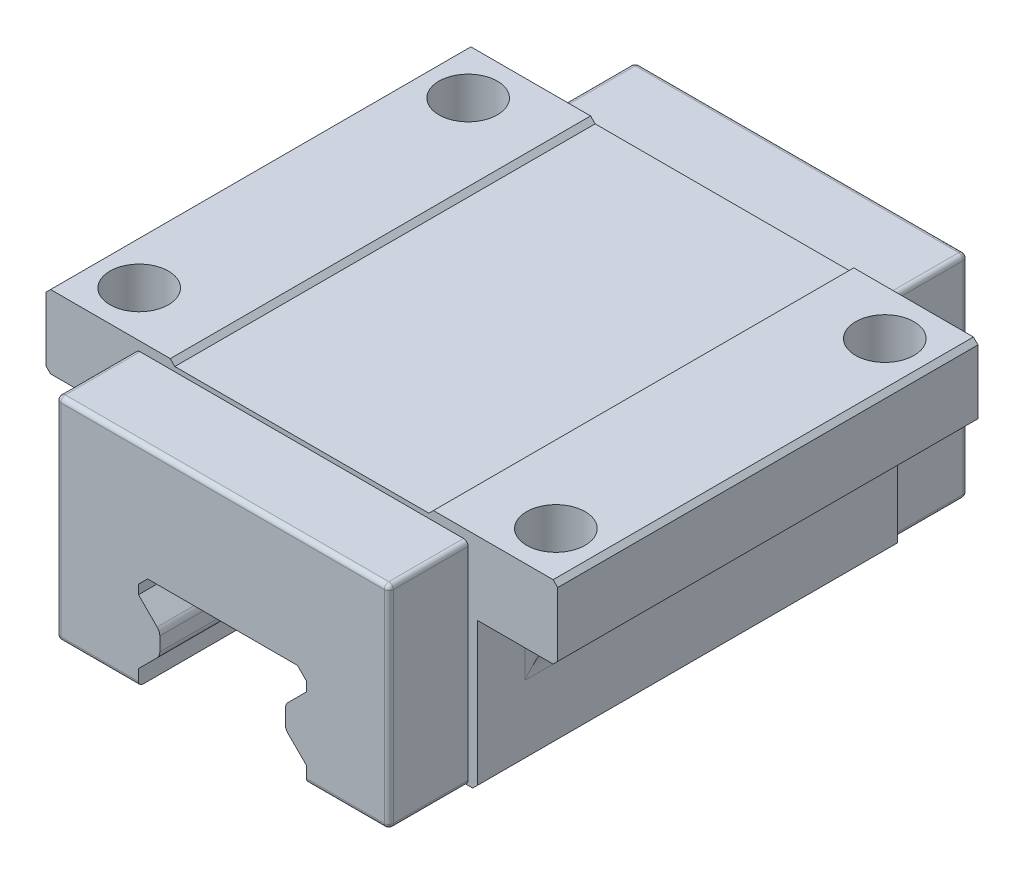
ISO-10303-21;
HEADER;
FILE_DESCRIPTION(('STEP AP214'),'2;1');
FILE_NAME('part.step','',(''),(''),'','','');
FILE_SCHEMA(('AUTOMOTIVE_DESIGN { 1 0 10303 214 1 1 1 1 }'));
ENDSEC;
DATA;
#1=APPLICATION_CONTEXT('core data for automotive mechanical design processes');
#2=APPLICATION_PROTOCOL_DEFINITION('international standard','automotive_design',2000,#1);
#3=PRODUCT_CONTEXT('',#1,'mechanical');
#4=PRODUCT('Part','Part','',(#3));
#5=PRODUCT_RELATED_PRODUCT_CATEGORY('part','',(#4));
#6=PRODUCT_DEFINITION_FORMATION('','',#4);
#7=PRODUCT_DEFINITION_CONTEXT('part definition',#1,'design');
#8=PRODUCT_DEFINITION('design','',#6,#7);
#9=PRODUCT_DEFINITION_SHAPE('','',#8);
#10=(LENGTH_UNIT() NAMED_UNIT(*) SI_UNIT(.MILLI.,.METRE.));
#11=(NAMED_UNIT(*) PLANE_ANGLE_UNIT() SI_UNIT($,.RADIAN.));
#12=(NAMED_UNIT(*) SI_UNIT($,.STERADIAN.) SOLID_ANGLE_UNIT());
#13=UNCERTAINTY_MEASURE_WITH_UNIT(LENGTH_MEASURE(1.E-05),#10,'distance_accuracy_value','');
#14=(GEOMETRIC_REPRESENTATION_CONTEXT(3) GLOBAL_UNCERTAINTY_ASSIGNED_CONTEXT((#13)) GLOBAL_UNIT_ASSIGNED_CONTEXT((#10,
#11,#12)) REPRESENTATION_CONTEXT('',''));
#15=CARTESIAN_POINT('',(0.,0.,0.));
#16=DIRECTION('',(0.,0.,1.));
#17=DIRECTION('',(1.,0.,0.));
#18=AXIS2_PLACEMENT_3D('',#15,#16,#17);
#19=CARTESIAN_POINT('',(35.,26.,16.25));
#20=DIRECTION('',(0.,1.,0.));
#21=DIRECTION('',(0.,0.,1.));
#22=AXIS2_PLACEMENT_3D('',#19,#20,#21);
#23=PLANE('',#22);
#24=CARTESIAN_POINT('',(28.5,26.,-22.5));
#25=DIRECTION('',(0.,-1.,0.));
#26=DIRECTION('',(-1.,0.,0.));
#27=AXIS2_PLACEMENT_3D('',#24,#25,#26);
#28=CIRCLE('',#27,4.);
#29=CARTESIAN_POINT('',(24.5,26.,-22.5));
#30=VERTEX_POINT('',#29);
#31=EDGE_CURVE('E1648',#30,#30,#28,.T.);
#32=ORIENTED_EDGE('',*,*,#31,.F.);
#33=EDGE_LOOP('',(#32));
#34=FACE_BOUND('',#33,.T.);
#35=DIRECTION('',(-1.,0.,0.));
#36=VECTOR('',#35,1.);
#37=CARTESIAN_POINT('',(34.375,26.,-16.25));
#38=LINE('',#37,#36);
#39=CARTESIAN_POINT('',(34.375,26.,-16.25));
#40=VERTEX_POINT('',#39);
#41=CARTESIAN_POINT('',(30.,26.,-16.25));
#42=VERTEX_POINT('',#41);
#43=EDGE_CURVE('E1637',#40,#42,#38,.T.);
#44=ORIENTED_EDGE('',*,*,#43,.T.);
#45=CARTESIAN_POINT('',(30.,26.,-22.25));
#46=DIRECTION('',(0.,1.,0.));
#47=DIRECTION('',(0.,0.,1.));
#48=AXIS2_PLACEMENT_3D('',#45,#46,#47);
#49=CIRCLE('',#48,6.);
#50=CARTESIAN_POINT('',(24.,26.,-22.25));
#51=VERTEX_POINT('',#50);
#52=EDGE_CURVE('E477',#42,#51,#49,.F.);
#53=ORIENTED_EDGE('',*,*,#52,.T.);
#54=DIRECTION('',(0.,0.,-1.));
#55=VECTOR('',#54,1.);
#56=CARTESIAN_POINT('',(24.,26.,28.75));
#57=LINE('',#56,#55);
#58=CARTESIAN_POINT('',(24.,26.,-28.75));
#59=VERTEX_POINT('',#58);
#60=EDGE_CURVE('E471',#51,#59,#57,.T.);
#61=ORIENTED_EDGE('',*,*,#60,.T.);
#62=DIRECTION('',(1.,0.,0.));
#63=VECTOR('',#62,1.);
#64=CARTESIAN_POINT('',(35.,26.,-28.75));
#65=LINE('',#64,#63);
#66=CARTESIAN_POINT('',(34.375,26.,-28.75));
#67=VERTEX_POINT('',#66);
#68=EDGE_CURVE('E475',#59,#67,#65,.T.);
#69=ORIENTED_EDGE('',*,*,#68,.T.);
#70=DIRECTION('',(0.,0.,1.));
#71=VECTOR('',#70,1.);
#72=CARTESIAN_POINT('',(34.375,26.,16.25));
#73=LINE('',#72,#71);
#74=EDGE_CURVE('E975',#67,#40,#73,.T.);
#75=ORIENTED_EDGE('',*,*,#74,.T.);
#76=EDGE_LOOP('',(#44,#53,#61,#69,#75));
#77=FACE_BOUND('',#76,.T.);
#78=ADVANCED_FACE('F39',(#34,#77),#23,.F.);
#79=CARTESIAN_POINT('',(-35.,26.,16.25));
#80=DIRECTION('',(0.,1.,0.));
#81=DIRECTION('',(0.,0.,1.));
#82=AXIS2_PLACEMENT_3D('',#79,#80,#81);
#83=PLANE('',#82);
#84=CARTESIAN_POINT('',(-28.5,26.,22.5));
#85=DIRECTION('',(0.,1.,0.));
#86=DIRECTION('',(-1.,0.,0.));
#87=AXIS2_PLACEMENT_3D('',#84,#85,#86);
#88=CIRCLE('',#87,4.);
#89=CARTESIAN_POINT('',(-32.5,26.,22.5));
#90=VERTEX_POINT('',#89);
#91=EDGE_CURVE('E495',#90,#90,#88,.T.);
#92=ORIENTED_EDGE('',*,*,#91,.T.);
#93=EDGE_LOOP('',(#92));
#94=FACE_BOUND('',#93,.T.);
#95=DIRECTION('',(1.,0.,0.));
#96=VECTOR('',#95,1.);
#97=CARTESIAN_POINT('',(-34.375,26.,16.25));
#98=LINE('',#97,#96);
#99=CARTESIAN_POINT('',(-34.375,26.,16.25));
#100=VERTEX_POINT('',#99);
#101=CARTESIAN_POINT('',(-30.,26.,16.25));
#102=VERTEX_POINT('',#101);
#103=EDGE_CURVE('E1358',#100,#102,#98,.T.);
#104=ORIENTED_EDGE('',*,*,#103,.T.);
#105=CARTESIAN_POINT('',(-30.,26.,22.25));
#106=DIRECTION('',(0.,1.,0.));
#107=DIRECTION('',(0.,0.,1.));
#108=AXIS2_PLACEMENT_3D('',#105,#106,#107);
#109=CIRCLE('',#108,6.);
#110=CARTESIAN_POINT('',(-24.,26.,22.25));
#111=VERTEX_POINT('',#110);
#112=EDGE_CURVE('E986',#102,#111,#109,.F.);
#113=ORIENTED_EDGE('',*,*,#112,.T.);
#114=DIRECTION('',(0.,0.,1.));
#115=VECTOR('',#114,1.);
#116=CARTESIAN_POINT('',(-24.,26.,28.75));
#117=LINE('',#116,#115);
#118=CARTESIAN_POINT('',(-24.,26.,28.75));
#119=VERTEX_POINT('',#118);
#120=EDGE_CURVE('E1362',#111,#119,#117,.T.);
#121=ORIENTED_EDGE('',*,*,#120,.T.);
#122=DIRECTION('',(1.,0.,0.));
#123=VECTOR('',#122,1.);
#124=CARTESIAN_POINT('',(-35.,26.,28.75));
#125=LINE('',#124,#123);
#126=CARTESIAN_POINT('',(-34.375,26.,28.75));
#127=VERTEX_POINT('',#126);
#128=EDGE_CURVE('E1343',#127,#119,#125,.T.);
#129=ORIENTED_EDGE('',*,*,#128,.F.);
#130=DIRECTION('',(0.,0.,-1.));
#131=VECTOR('',#130,1.);
#132=CARTESIAN_POINT('',(-34.375,26.,16.25));
#133=LINE('',#132,#131);
#134=EDGE_CURVE('E928',#127,#100,#133,.T.);
#135=ORIENTED_EDGE('',*,*,#134,.T.);
#136=EDGE_LOOP('',(#104,#113,#121,#129,#135));
#137=FACE_BOUND('',#136,.T.);
#138=ADVANCED_FACE('F1051',(#94,#137),#83,.F.);
#139=CARTESIAN_POINT('',(24.,5.8,28.75));
#140=DIRECTION('',(-1.,0.,0.));
#141=DIRECTION('',(0.,0.,1.));
#142=AXIS2_PLACEMENT_3D('',#139,#140,#141);
#143=PLANE('',#142);
#144=ORIENTED_EDGE('',*,*,#60,.F.);
#145=DIRECTION('',(0.,1.,0.));
#146=VECTOR('',#145,1.);
#147=CARTESIAN_POINT('',(24.,15.625,-22.25));
#148=LINE('',#147,#146);
#149=CARTESIAN_POINT('',(24.,15.625,-22.25));
#150=VERTEX_POINT('',#149);
#151=EDGE_CURVE('E1013',#51,#150,#148,.F.);
#152=ORIENTED_EDGE('',*,*,#151,.T.);
#153=DIRECTION('',(0.,0.,-1.));
#154=VECTOR('',#153,1.);
#155=CARTESIAN_POINT('',(24.,15.625,16.25));
#156=LINE('',#155,#154);
#157=CARTESIAN_POINT('',(24.,15.625,22.25));
#158=VERTEX_POINT('',#157);
#159=EDGE_CURVE('E1369',#158,#150,#156,.T.);
#160=ORIENTED_EDGE('',*,*,#159,.F.);
#161=DIRECTION('',(0.,1.,0.));
#162=VECTOR('',#161,1.);
#163=CARTESIAN_POINT('',(24.,5.8,22.25));
#164=LINE('',#163,#162);
#165=CARTESIAN_POINT('',(24.,26.,22.25));
#166=VERTEX_POINT('',#165);
#167=EDGE_CURVE('E1009',#158,#166,#164,.T.);
#168=ORIENTED_EDGE('',*,*,#167,.T.);
#169=CARTESIAN_POINT('',(24.,26.,28.75));
#170=VERTEX_POINT('',#169);
#171=EDGE_CURVE('E483',#170,#166,#57,.T.);
#172=ORIENTED_EDGE('',*,*,#171,.F.);
#173=DIRECTION('',(0.,1.,0.));
#174=VECTOR('',#173,1.);
#175=CARTESIAN_POINT('',(24.,5.8,28.75));
#176=LINE('',#175,#174);
#177=CARTESIAN_POINT('',(24.,6.425,28.75));
#178=VERTEX_POINT('',#177);
#179=EDGE_CURVE('E527',#178,#170,#176,.T.);
#180=ORIENTED_EDGE('',*,*,#179,.F.);
#181=DIRECTION('',(0.,0.,-1.));
#182=VECTOR('',#181,1.);
#183=CARTESIAN_POINT('',(24.,6.425,28.75));
#184=LINE('',#183,#182);
#185=CARTESIAN_POINT('',(24.,6.425,-28.75));
#186=VERTEX_POINT('',#185);
#187=EDGE_CURVE('E501',#178,#186,#184,.T.);
#188=ORIENTED_EDGE('',*,*,#187,.T.);
#189=DIRECTION('',(0.,1.,0.));
#190=VECTOR('',#189,1.);
#191=CARTESIAN_POINT('',(24.,5.8,-28.75));
#192=LINE('',#191,#190);
#193=EDGE_CURVE('E490',#186,#59,#192,.T.);
#194=ORIENTED_EDGE('',*,*,#193,.T.);
#195=EDGE_LOOP('',(#144,#152,#160,#168,#172,#180,#188,#194));
#196=FACE_BOUND('',#195,.T.);
#197=ADVANCED_FACE('F498',(#196),#143,.F.);
#198=CARTESIAN_POINT('',(34.375,15.625,16.25));
#199=DIRECTION('',(0.,0.,1.));
#200=DIRECTION('',(1.,0.,0.));
#201=AXIS2_PLACEMENT_3D('',#198,#199,#200);
#202=PLANE('',#201);
#203=DIRECTION('',(-1.,0.,0.));
#204=VECTOR('',#203,1.);
#205=CARTESIAN_POINT('',(34.375,26.,16.25));
#206=LINE('',#205,#204);
#207=CARTESIAN_POINT('',(34.375,26.,16.25));
#208=VERTEX_POINT('',#207);
#209=CARTESIAN_POINT('',(30.,26.,16.25));
#210=VERTEX_POINT('',#209);
#211=EDGE_CURVE('E484',#208,#210,#206,.T.);
#212=ORIENTED_EDGE('',*,*,#211,.T.);
#213=DIRECTION('',(0.,1.,0.));
#214=VECTOR('',#213,1.);
#215=CARTESIAN_POINT('',(30.,15.625,16.25));
#216=LINE('',#215,#214);
#217=CARTESIAN_POINT('',(30.,25.0324438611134,16.25));
#218=VERTEX_POINT('',#217);
#219=EDGE_CURVE('E60',#210,#218,#216,.F.);
#220=ORIENTED_EDGE('',*,*,#219,.T.);
#221=CARTESIAN_POINT('',(34.375,15.625,16.25));
#222=DIRECTION('',(0.,0.,-1.));
#223=DIRECTION('',(1.,0.,0.));
#224=AXIS2_PLACEMENT_3D('',#221,#222,#223);
#225=CIRCLE('',#224,10.375);
#226=EDGE_CURVE('E1366',#218,#208,#225,.T.);
#227=ORIENTED_EDGE('',*,*,#226,.T.);
#228=EDGE_LOOP('',(#212,#220,#227));
#229=FACE_BOUND('',#228,.T.);
#230=ADVANCED_FACE('F1148',(#229),#202,.T.);
#231=CARTESIAN_POINT('',(34.375,15.625,-16.25));
#232=DIRECTION('',(0.,0.,1.));
#233=DIRECTION('',(1.,0.,0.));
#234=AXIS2_PLACEMENT_3D('',#231,#232,#233);
#235=PLANE('',#234);
#236=CARTESIAN_POINT('',(34.375,15.625,-16.25));
#237=DIRECTION('',(0.,0.,-1.));
#238=DIRECTION('',(1.,0.,0.));
#239=AXIS2_PLACEMENT_3D('',#236,#237,#238);
#240=CIRCLE('',#239,10.375);
#241=CARTESIAN_POINT('',(30.,25.0324438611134,-16.25));
#242=VERTEX_POINT('',#241);
#243=EDGE_CURVE('E1370',#242,#40,#240,.T.);
#244=ORIENTED_EDGE('',*,*,#243,.F.);
#245=DIRECTION('',(0.,1.,0.));
#246=VECTOR('',#245,1.);
#247=CARTESIAN_POINT('',(30.,26.,-16.25));
#248=LINE('',#247,#246);
#249=EDGE_CURVE('E1003',#242,#42,#248,.T.);
#250=ORIENTED_EDGE('',*,*,#249,.T.);
#251=ORIENTED_EDGE('',*,*,#43,.F.);
#252=EDGE_LOOP('',(#244,#250,#251));
#253=FACE_BOUND('',#252,.T.);
#254=ADVANCED_FACE('F1140',(#253),#235,.F.);
#255=CARTESIAN_POINT('',(-24.,5.8,28.75));
#256=DIRECTION('',(1.,0.,0.));
#257=DIRECTION('',(0.,0.,-1.));
#258=AXIS2_PLACEMENT_3D('',#255,#256,#257);
#259=PLANE('',#258);
#260=ORIENTED_EDGE('',*,*,#120,.F.);
#261=DIRECTION('',(0.,1.,0.));
#262=VECTOR('',#261,1.);
#263=CARTESIAN_POINT('',(-24.,15.625,22.25));
#264=LINE('',#263,#262);
#265=CARTESIAN_POINT('',(-24.,15.625,22.25));
#266=VERTEX_POINT('',#265);
#267=EDGE_CURVE('E993',#111,#266,#264,.F.);
#268=ORIENTED_EDGE('',*,*,#267,.T.);
#269=DIRECTION('',(0.,0.,-1.));
#270=VECTOR('',#269,1.);
#271=CARTESIAN_POINT('',(-24.,15.625,16.25));
#272=LINE('',#271,#270);
#273=CARTESIAN_POINT('',(-24.,15.625,-22.25));
#274=VERTEX_POINT('',#273);
#275=EDGE_CURVE('E1384',#266,#274,#272,.T.);
#276=ORIENTED_EDGE('',*,*,#275,.T.);
#277=DIRECTION('',(0.,1.,0.));
#278=VECTOR('',#277,1.);
#279=CARTESIAN_POINT('',(-24.,5.8,-22.25));
#280=LINE('',#279,#278);
#281=CARTESIAN_POINT('',(-24.,26.,-22.25));
#282=VERTEX_POINT('',#281);
#283=EDGE_CURVE('E989',#274,#282,#280,.T.);
#284=ORIENTED_EDGE('',*,*,#283,.T.);
#285=CARTESIAN_POINT('',(-24.,26.,-28.75));
#286=VERTEX_POINT('',#285);
#287=EDGE_CURVE('E1365',#286,#282,#117,.T.);
#288=ORIENTED_EDGE('',*,*,#287,.F.);
#289=DIRECTION('',(0.,-1.,0.));
#290=VECTOR('',#289,1.);
#291=CARTESIAN_POINT('',(-24.,5.8,-28.75));
#292=LINE('',#291,#290);
#293=CARTESIAN_POINT('',(-24.,6.425,-28.75));
#294=VERTEX_POINT('',#293);
#295=EDGE_CURVE('E520',#286,#294,#292,.T.);
#296=ORIENTED_EDGE('',*,*,#295,.T.);
#297=DIRECTION('',(0.,0.,1.));
#298=VECTOR('',#297,1.);
#299=CARTESIAN_POINT('',(-24.,6.425,28.75));
#300=LINE('',#299,#298);
#301=CARTESIAN_POINT('',(-24.,6.425,28.75));
#302=VERTEX_POINT('',#301);
#303=EDGE_CURVE('E654',#294,#302,#300,.T.);
#304=ORIENTED_EDGE('',*,*,#303,.T.);
#305=DIRECTION('',(0.,-1.,0.));
#306=VECTOR('',#305,1.);
#307=CARTESIAN_POINT('',(-24.,5.8,28.75));
#308=LINE('',#307,#306);
#309=EDGE_CURVE('E1498',#119,#302,#308,.T.);
#310=ORIENTED_EDGE('',*,*,#309,.F.);
#311=EDGE_LOOP('',(#260,#268,#276,#284,#288,#296,#304,#310));
#312=FACE_BOUND('',#311,.T.);
#313=ADVANCED_FACE('F1136',(#312),#259,.F.);
#314=CARTESIAN_POINT('',(-34.375,15.625,16.25));
#315=DIRECTION('',(0.,0.,-1.));
#316=DIRECTION('',(-1.,0.,0.));
#317=AXIS2_PLACEMENT_3D('',#314,#315,#316);
#318=PLANE('',#317);
#319=CARTESIAN_POINT('',(-34.375,15.625,16.25));
#320=DIRECTION('',(0.,0.,-1.));
#321=DIRECTION('',(-1.,0.,0.));
#322=AXIS2_PLACEMENT_3D('',#319,#320,#321);
#323=CIRCLE('',#322,10.375);
#324=CARTESIAN_POINT('',(-30.,25.0324438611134,16.25));
#325=VERTEX_POINT('',#324);
#326=EDGE_CURVE('E1380',#100,#325,#323,.T.);
#327=ORIENTED_EDGE('',*,*,#326,.T.);
#328=DIRECTION('',(0.,1.,0.));
#329=VECTOR('',#328,1.);
#330=CARTESIAN_POINT('',(-30.,26.,16.25));
#331=LINE('',#330,#329);
#332=EDGE_CURVE('E982',#325,#102,#331,.T.);
#333=ORIENTED_EDGE('',*,*,#332,.T.);
#334=ORIENTED_EDGE('',*,*,#103,.F.);
#335=EDGE_LOOP('',(#327,#333,#334));
#336=FACE_BOUND('',#335,.T.);
#337=ADVANCED_FACE('F1139',(#336),#318,.F.);
#338=CARTESIAN_POINT('',(-34.375,15.625,-16.25));
#339=DIRECTION('',(0.,0.,-1.));
#340=DIRECTION('',(-1.,0.,0.));
#341=AXIS2_PLACEMENT_3D('',#338,#339,#340);
#342=PLANE('',#341);
#343=DIRECTION('',(1.,0.,0.));
#344=VECTOR('',#343,1.);
#345=CARTESIAN_POINT('',(-34.375,26.,-16.25));
#346=LINE('',#345,#344);
#347=CARTESIAN_POINT('',(-34.375,26.,-16.25));
#348=VERTEX_POINT('',#347);
#349=CARTESIAN_POINT('',(-30.,26.,-16.25));
#350=VERTEX_POINT('',#349);
#351=EDGE_CURVE('E1350',#348,#350,#346,.T.);
#352=ORIENTED_EDGE('',*,*,#351,.T.);
#353=DIRECTION('',(0.,1.,0.));
#354=VECTOR('',#353,1.);
#355=CARTESIAN_POINT('',(-30.,15.625,-16.25));
#356=LINE('',#355,#354);
#357=CARTESIAN_POINT('',(-30.,25.0324438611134,-16.25));
#358=VERTEX_POINT('',#357);
#359=EDGE_CURVE('E1000',#350,#358,#356,.F.);
#360=ORIENTED_EDGE('',*,*,#359,.T.);
#361=CARTESIAN_POINT('',(-34.375,15.625,-16.25));
#362=DIRECTION('',(0.,0.,-1.));
#363=DIRECTION('',(-1.,0.,0.));
#364=AXIS2_PLACEMENT_3D('',#361,#362,#363);
#365=CIRCLE('',#364,10.375);
#366=EDGE_CURVE('E1379',#348,#358,#365,.T.);
#367=ORIENTED_EDGE('',*,*,#366,.F.);
#368=EDGE_LOOP('',(#352,#360,#367));
#369=FACE_BOUND('',#368,.T.);
#370=ADVANCED_FACE('F1044',(#369),#342,.T.);
#371=CARTESIAN_POINT('',(-24.,36.,28.75));
#372=DIRECTION('',(0.,-1.,0.));
#373=DIRECTION('',(1.,0.,0.));
#374=AXIS2_PLACEMENT_3D('',#371,#372,#373);
#375=PLANE('',#374);
#376=CARTESIAN_POINT('',(-28.5,36.,-22.5));
#377=DIRECTION('',(0.,-1.,0.));
#378=DIRECTION('',(-1.,0.,0.));
#379=AXIS2_PLACEMENT_3D('',#376,#377,#378);
#380=CIRCLE('',#379,4.);
#381=CARTESIAN_POINT('',(-32.5,36.,-22.5));
#382=VERTEX_POINT('',#381);
#383=EDGE_CURVE('E1709',#382,#382,#380,.T.);
#384=ORIENTED_EDGE('',*,*,#383,.T.);
#385=EDGE_LOOP('',(#384));
#386=FACE_BOUND('',#385,.T.);
#387=CARTESIAN_POINT('',(-28.5,36.,22.5));
#388=DIRECTION('',(0.,1.,0.));
#389=DIRECTION('',(-1.,0.,0.));
#390=AXIS2_PLACEMENT_3D('',#387,#388,#389);
#391=CIRCLE('',#390,4.);
#392=CARTESIAN_POINT('',(-32.5,36.,22.5));
#393=VERTEX_POINT('',#392);
#394=EDGE_CURVE('E1723',#393,#393,#391,.T.);
#395=ORIENTED_EDGE('',*,*,#394,.F.);
#396=EDGE_LOOP('',(#395));
#397=FACE_BOUND('',#396,.T.);
#398=DIRECTION('',(-1.,0.,0.));
#399=VECTOR('',#398,1.);
#400=CARTESIAN_POINT('',(-24.,36.,-28.75));
#401=LINE('',#400,#399);
#402=CARTESIAN_POINT('',(-18.,36.,-28.75));
#403=VERTEX_POINT('',#402);
#404=CARTESIAN_POINT('',(-34.375,36.,-28.75));
#405=VERTEX_POINT('',#404);
#406=EDGE_CURVE('E503',#403,#405,#401,.T.);
#407=ORIENTED_EDGE('',*,*,#406,.T.);
#408=DIRECTION('',(0.,0.,1.));
#409=VECTOR('',#408,1.);
#410=CARTESIAN_POINT('',(-34.375,36.,28.75));
#411=LINE('',#410,#409);
#412=CARTESIAN_POINT('',(-34.375,36.,28.75));
#413=VERTEX_POINT('',#412);
#414=EDGE_CURVE('E962',#405,#413,#411,.T.);
#415=ORIENTED_EDGE('',*,*,#414,.T.);
#416=DIRECTION('',(-1.,0.,0.));
#417=VECTOR('',#416,1.);
#418=CARTESIAN_POINT('',(-24.,36.,28.75));
#419=LINE('',#418,#417);
#420=CARTESIAN_POINT('',(-18.,36.,28.75));
#421=VERTEX_POINT('',#420);
#422=EDGE_CURVE('E1495',#421,#413,#419,.T.);
#423=ORIENTED_EDGE('',*,*,#422,.F.);
#424=DIRECTION('',(0.,0.,-1.));
#425=VECTOR('',#424,1.);
#426=CARTESIAN_POINT('',(-18.,36.,28.75));
#427=LINE('',#426,#425);
#428=EDGE_CURVE('E625',#421,#403,#427,.T.);
#429=ORIENTED_EDGE('',*,*,#428,.T.);
#430=EDGE_LOOP('',(#407,#415,#423,#429));
#431=FACE_BOUND('',#430,.T.);
#432=ADVANCED_FACE('F1145',(#386,#397,#431),#375,.F.);
#433=CARTESIAN_POINT('',(11.5,19.2,-39.6));
#434=DIRECTION('',(1.,0.,0.));
#435=DIRECTION('',(0.,1.,0.));
#436=AXIS2_PLACEMENT_3D('',#433,#434,#435);
#437=PLANE('',#436);
#438=DIRECTION('',(0.,-1.,0.));
#439=VECTOR('',#438,1.);
#440=CARTESIAN_POINT('',(11.5,0.,39.6));
#441=LINE('',#440,#439);
#442=CARTESIAN_POINT('',(11.5,17.95,39.6));
#443=VERTEX_POINT('',#442);
#444=CARTESIAN_POINT('',(11.5,16.7,39.6));
#445=VERTEX_POINT('',#444);
#446=EDGE_CURVE('E540',#443,#445,#441,.T.);
#447=ORIENTED_EDGE('',*,*,#446,.F.);
#448=DIRECTION('',(0.,0.,-1.));
#449=VECTOR('',#448,1.);
#450=CARTESIAN_POINT('',(11.5,17.95,-39.6));
#451=LINE('',#450,#449);
#452=CARTESIAN_POINT('',(11.5,17.95,-39.6));
#453=VERTEX_POINT('',#452);
#454=EDGE_CURVE('E550',#443,#453,#451,.T.);
#455=ORIENTED_EDGE('',*,*,#454,.T.);
#456=DIRECTION('',(0.,1.,0.));
#457=VECTOR('',#456,1.);
#458=CARTESIAN_POINT('',(11.5,19.2,-39.6));
#459=LINE('',#458,#457);
#460=CARTESIAN_POINT('',(11.5,16.7,-39.6));
#461=VERTEX_POINT('',#460);
#462=EDGE_CURVE('E1461',#461,#453,#459,.T.);
#463=ORIENTED_EDGE('',*,*,#462,.F.);
#464=DIRECTION('',(0.,0.,1.));
#465=VECTOR('',#464,1.);
#466=CARTESIAN_POINT('',(11.5,16.7,-48.8233098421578));
#467=LINE('',#466,#465);
#468=EDGE_CURVE('E1400',#461,#445,#467,.T.);
#469=ORIENTED_EDGE('',*,*,#468,.T.);
#470=EDGE_LOOP('',(#447,#455,#463,#469));
#471=FACE_BOUND('',#470,.T.);
#472=ADVANCED_FACE('F1101',(#471),#437,.F.);
#473=CARTESIAN_POINT('',(-11.5,19.2,-39.6));
#474=DIRECTION('',(-1.,0.,0.));
#475=DIRECTION('',(0.,-1.,0.));
#476=AXIS2_PLACEMENT_3D('',#473,#474,#475);
#477=PLANE('',#476);
#478=DIRECTION('',(0.,-1.,0.));
#479=VECTOR('',#478,1.);
#480=CARTESIAN_POINT('',(-11.5,19.2,39.6));
#481=LINE('',#480,#479);
#482=CARTESIAN_POINT('',(-11.5,7.95,39.6));
#483=VERTEX_POINT('',#482);
#484=CARTESIAN_POINT('',(-11.5,6.425,39.6));
#485=VERTEX_POINT('',#484);
#486=EDGE_CURVE('E1474',#483,#485,#481,.T.);
#487=ORIENTED_EDGE('',*,*,#486,.T.);
#488=CARTESIAN_POINT('',(-11.5,6.425,38.975));
#489=DIRECTION('',(-1.,0.,0.));
#490=DIRECTION('',(0.,-1.,0.));
#491=AXIS2_PLACEMENT_3D('',#488,#489,#490);
#492=CIRCLE('',#491,0.625);
#493=CARTESIAN_POINT('',(-11.5,5.8,38.975));
#494=VERTEX_POINT('',#493);
#495=EDGE_CURVE('E763',#485,#494,#492,.F.);
#496=ORIENTED_EDGE('',*,*,#495,.T.);
#497=DIRECTION('',(0.,0.,1.));
#498=VECTOR('',#497,1.);
#499=CARTESIAN_POINT('',(-11.5,5.8,28.75));
#500=LINE('',#499,#498);
#501=CARTESIAN_POINT('',(-11.5,5.8,-38.975));
#502=VERTEX_POINT('',#501);
#503=EDGE_CURVE('E1470',#502,#494,#500,.T.);
#504=ORIENTED_EDGE('',*,*,#503,.F.);
#505=CARTESIAN_POINT('',(-11.5,6.425,-38.975));
#506=DIRECTION('',(-1.,0.,0.));
#507=DIRECTION('',(0.,-1.,0.));
#508=AXIS2_PLACEMENT_3D('',#505,#506,#507);
#509=CIRCLE('',#508,0.625);
#510=CARTESIAN_POINT('',(-11.5,6.425,-39.6));
#511=VERTEX_POINT('',#510);
#512=EDGE_CURVE('E760',#502,#511,#509,.F.);
#513=ORIENTED_EDGE('',*,*,#512,.T.);
#514=DIRECTION('',(0.,-1.,0.));
#515=VECTOR('',#514,1.);
#516=CARTESIAN_POINT('',(-11.5,19.2,-39.6));
#517=LINE('',#516,#515);
#518=CARTESIAN_POINT('',(-11.5,7.95,-39.6));
#519=VERTEX_POINT('',#518);
#520=EDGE_CURVE('E1465',#519,#511,#517,.T.);
#521=ORIENTED_EDGE('',*,*,#520,.F.);
#522=DIRECTION('',(0.,0.,1.));
#523=VECTOR('',#522,1.);
#524=CARTESIAN_POINT('',(-11.5,7.95,-48.8233098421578));
#525=LINE('',#524,#523);
#526=EDGE_CURVE('E1431',#519,#483,#525,.T.);
#527=ORIENTED_EDGE('',*,*,#526,.T.);
#528=EDGE_LOOP('',(#487,#496,#504,#513,#521,#527));
#529=FACE_BOUND('',#528,.T.);
#530=ADVANCED_FACE('F1093',(#529),#477,.F.);
#531=CARTESIAN_POINT('',(-24.,5.8,28.75));
#532=DIRECTION('',(0.,1.,0.));
#533=DIRECTION('',(-1.,0.,0.));
#534=AXIS2_PLACEMENT_3D('',#531,#532,#533);
#535=PLANE('',#534);
#536=DIRECTION('',(0.,0.,-1.));
#537=VECTOR('',#536,1.);
#538=CARTESIAN_POINT('',(22.125,5.8,28.75));
#539=LINE('',#538,#537);
#540=CARTESIAN_POINT('',(22.125,5.8,28.75));
#541=VERTEX_POINT('',#540);
#542=CARTESIAN_POINT('',(22.125,5.8,38.975));
#543=VERTEX_POINT('',#542);
#544=EDGE_CURVE('E709',#541,#543,#539,.F.);
#545=ORIENTED_EDGE('',*,*,#544,.T.);
#546=DIRECTION('',(1.,0.,0.));
#547=VECTOR('',#546,1.);
#548=CARTESIAN_POINT('',(-24.,5.8,38.975));
#549=LINE('',#548,#547);
#550=CARTESIAN_POINT('',(11.5,5.8,38.975));
#551=VERTEX_POINT('',#550);
#552=EDGE_CURVE('E712',#543,#551,#549,.F.);
#553=ORIENTED_EDGE('',*,*,#552,.T.);
#554=DIRECTION('',(0.,0.,-1.));
#555=VECTOR('',#554,1.);
#556=CARTESIAN_POINT('',(11.5,5.8,28.75));
#557=LINE('',#556,#555);
#558=CARTESIAN_POINT('',(11.5,5.8,-38.975));
#559=VERTEX_POINT('',#558);
#560=EDGE_CURVE('E1482',#551,#559,#557,.T.);
#561=ORIENTED_EDGE('',*,*,#560,.T.);
#562=DIRECTION('',(1.,0.,0.));
#563=VECTOR('',#562,1.);
#564=CARTESIAN_POINT('',(22.75,5.8,-38.975));
#565=LINE('',#564,#563);
#566=CARTESIAN_POINT('',(22.125,5.8,-38.975));
#567=VERTEX_POINT('',#566);
#568=EDGE_CURVE('E706',#559,#567,#565,.T.);
#569=ORIENTED_EDGE('',*,*,#568,.T.);
#570=DIRECTION('',(0.,0.,-1.));
#571=VECTOR('',#570,1.);
#572=CARTESIAN_POINT('',(22.125,5.8,28.75));
#573=LINE('',#572,#571);
#574=CARTESIAN_POINT('',(22.125,5.8,-28.75));
#575=VERTEX_POINT('',#574);
#576=EDGE_CURVE('E702',#567,#575,#573,.F.);
#577=ORIENTED_EDGE('',*,*,#576,.T.);
#578=DIRECTION('',(1.,0.,0.));
#579=VECTOR('',#578,1.);
#580=CARTESIAN_POINT('',(-24.,5.8,-28.75));
#581=LINE('',#580,#579);
#582=CARTESIAN_POINT('',(23.375,5.8,-28.75));
#583=VERTEX_POINT('',#582);
#584=EDGE_CURVE('E523',#575,#583,#581,.T.);
#585=ORIENTED_EDGE('',*,*,#584,.T.);
#586=DIRECTION('',(0.,0.,1.));
#587=VECTOR('',#586,1.);
#588=CARTESIAN_POINT('',(23.375,5.8,28.75));
#589=LINE('',#588,#587);
#590=CARTESIAN_POINT('',(23.375,5.8,28.75));
#591=VERTEX_POINT('',#590);
#592=EDGE_CURVE('E647',#583,#591,#589,.T.);
#593=ORIENTED_EDGE('',*,*,#592,.T.);
#594=DIRECTION('',(1.,0.,0.));
#595=VECTOR('',#594,1.);
#596=CARTESIAN_POINT('',(-24.,5.8,28.75));
#597=LINE('',#596,#595);
#598=EDGE_CURVE('E1500',#541,#591,#597,.T.);
#599=ORIENTED_EDGE('',*,*,#598,.F.);
#600=EDGE_LOOP('',(#545,#553,#561,#569,#577,#585,#593,#599));
#601=FACE_BOUND('',#600,.T.);
#602=ADVANCED_FACE('F1128',(#601),#535,.F.);
#603=CARTESIAN_POINT('',(0.,0.,28.75));
#604=DIRECTION('',(0.,0.,-1.));
#605=DIRECTION('',(-1.,0.,0.));
#606=AXIS2_PLACEMENT_3D('',#603,#604,#605);
#607=PLANE('',#606);
#608=DIRECTION('',(0.,-1.,0.));
#609=VECTOR('',#608,1.);
#610=CARTESIAN_POINT('',(-35.,26.,28.75));
#611=LINE('',#610,#609);
#612=CARTESIAN_POINT('',(-35.,35.375,28.75));
#613=VERTEX_POINT('',#612);
#614=CARTESIAN_POINT('',(-35.,26.625,28.75));
#615=VERTEX_POINT('',#614);
#616=EDGE_CURVE('E1347',#613,#615,#611,.T.);
#617=ORIENTED_EDGE('',*,*,#616,.T.);
#618=DIRECTION('',(-0.707106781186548,0.707106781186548,0.));
#619=VECTOR('',#618,1.);
#620=CARTESIAN_POINT('',(-34.375,26.,28.75));
#621=LINE('',#620,#619);
#622=EDGE_CURVE('E959',#615,#127,#621,.F.);
#623=ORIENTED_EDGE('',*,*,#622,.T.);
#624=ORIENTED_EDGE('',*,*,#128,.T.);
#625=ORIENTED_EDGE('',*,*,#309,.T.);
#626=DIRECTION('',(-0.707106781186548,0.707106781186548,0.));
#627=VECTOR('',#626,1.);
#628=CARTESIAN_POINT('',(-23.375,5.8,28.75));
#629=LINE('',#628,#627);
#630=CARTESIAN_POINT('',(-23.375,5.8,28.75));
#631=VERTEX_POINT('',#630);
#632=EDGE_CURVE('E641',#302,#631,#629,.F.);
#633=ORIENTED_EDGE('',*,*,#632,.T.);
#634=CARTESIAN_POINT('',(-22.125,5.8,28.75));
#635=VERTEX_POINT('',#634);
#636=EDGE_CURVE('E516',#631,#635,#597,.T.);
#637=ORIENTED_EDGE('',*,*,#636,.T.);
#638=CARTESIAN_POINT('',(-22.125,6.425,28.75));
#639=DIRECTION('',(0.,0.,-1.));
#640=DIRECTION('',(-1.,0.,0.));
#641=AXIS2_PLACEMENT_3D('',#638,#639,#640);
#642=CIRCLE('',#641,0.625);
#643=CARTESIAN_POINT('',(-22.75,6.425,28.75));
#644=VERTEX_POINT('',#643);
#645=EDGE_CURVE('E806',#635,#644,#642,.T.);
#646=ORIENTED_EDGE('',*,*,#645,.T.);
#647=DIRECTION('',(0.,-1.,0.));
#648=VECTOR('',#647,1.);
#649=CARTESIAN_POINT('',(-22.75,0.,28.75));
#650=LINE('',#649,#648);
#651=CARTESIAN_POINT('',(-22.75,34.125,28.75));
#652=VERTEX_POINT('',#651);
#653=EDGE_CURVE('E504',#652,#644,#650,.T.);
#654=ORIENTED_EDGE('',*,*,#653,.F.);
#655=CARTESIAN_POINT('',(-22.125,34.125,28.75));
#656=DIRECTION('',(0.,0.,-1.));
#657=DIRECTION('',(-1.,0.,0.));
#658=AXIS2_PLACEMENT_3D('',#655,#656,#657);
#659=CIRCLE('',#658,0.625);
#660=CARTESIAN_POINT('',(-22.125,34.75,28.75));
#661=VERTEX_POINT('',#660);
#662=EDGE_CURVE('E813',#652,#661,#659,.T.);
#663=ORIENTED_EDGE('',*,*,#662,.T.);
#664=DIRECTION('',(-1.,0.,0.));
#665=VECTOR('',#664,1.);
#666=CARTESIAN_POINT('',(0.,34.75,28.75));
#667=LINE('',#666,#665);
#668=CARTESIAN_POINT('',(22.125,34.75,28.75));
#669=VERTEX_POINT('',#668);
#670=EDGE_CURVE('E1486',#669,#661,#667,.T.);
#671=ORIENTED_EDGE('',*,*,#670,.F.);
#672=CARTESIAN_POINT('',(22.125,34.125,28.75));
#673=DIRECTION('',(0.,0.,-1.));
#674=DIRECTION('',(-1.,0.,0.));
#675=AXIS2_PLACEMENT_3D('',#672,#673,#674);
#676=CIRCLE('',#675,0.625);
#677=CARTESIAN_POINT('',(22.75,34.125,28.75));
#678=VERTEX_POINT('',#677);
#679=EDGE_CURVE('E816',#669,#678,#676,.T.);
#680=ORIENTED_EDGE('',*,*,#679,.T.);
#681=DIRECTION('',(0.,1.,0.));
#682=VECTOR('',#681,1.);
#683=CARTESIAN_POINT('',(22.75,0.,28.75));
#684=LINE('',#683,#682);
#685=CARTESIAN_POINT('',(22.75,6.425,28.75));
#686=VERTEX_POINT('',#685);
#687=EDGE_CURVE('E513',#686,#678,#684,.T.);
#688=ORIENTED_EDGE('',*,*,#687,.F.);
#689=CARTESIAN_POINT('',(22.125,6.425,28.75));
#690=DIRECTION('',(0.,0.,-1.));
#691=DIRECTION('',(-1.,0.,0.));
#692=AXIS2_PLACEMENT_3D('',#689,#690,#691);
#693=CIRCLE('',#692,0.625);
#694=EDGE_CURVE('E810',#686,#541,#693,.T.);
#695=ORIENTED_EDGE('',*,*,#694,.T.);
#696=ORIENTED_EDGE('',*,*,#598,.T.);
#697=DIRECTION('',(-0.707106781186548,-0.707106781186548,0.));
#698=VECTOR('',#697,1.);
#699=CARTESIAN_POINT('',(24.,6.425,28.75));
#700=LINE('',#699,#698);
#701=EDGE_CURVE('E644',#591,#178,#700,.F.);
#702=ORIENTED_EDGE('',*,*,#701,.T.);
#703=ORIENTED_EDGE('',*,*,#179,.T.);
#704=DIRECTION('',(1.,0.,0.));
#705=VECTOR('',#704,1.);
#706=CARTESIAN_POINT('',(35.,26.,28.75));
#707=LINE('',#706,#705);
#708=CARTESIAN_POINT('',(34.375,26.,28.75));
#709=VERTEX_POINT('',#708);
#710=EDGE_CURVE('E1333',#170,#709,#707,.T.);
#711=ORIENTED_EDGE('',*,*,#710,.T.);
#712=DIRECTION('',(-0.707106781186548,-0.707106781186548,0.));
#713=VECTOR('',#712,1.);
#714=CARTESIAN_POINT('',(35.,26.625,28.75));
#715=LINE('',#714,#713);
#716=CARTESIAN_POINT('',(35.,26.625,28.75));
#717=VERTEX_POINT('',#716);
#718=EDGE_CURVE('E953',#709,#717,#715,.F.);
#719=ORIENTED_EDGE('',*,*,#718,.T.);
#720=DIRECTION('',(0.,1.,0.));
#721=VECTOR('',#720,1.);
#722=CARTESIAN_POINT('',(35.,26.,28.75));
#723=LINE('',#722,#721);
#724=CARTESIAN_POINT('',(35.,35.375,28.75));
#725=VERTEX_POINT('',#724);
#726=EDGE_CURVE('E1634',#717,#725,#723,.T.);
#727=ORIENTED_EDGE('',*,*,#726,.T.);
#728=DIRECTION('',(0.707106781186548,-0.707106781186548,0.));
#729=VECTOR('',#728,1.);
#730=CARTESIAN_POINT('',(34.375,36.,28.75));
#731=LINE('',#730,#729);
#732=CARTESIAN_POINT('',(34.375,36.,28.75));
#733=VERTEX_POINT('',#732);
#734=EDGE_CURVE('E950',#725,#733,#731,.F.);
#735=ORIENTED_EDGE('',*,*,#734,.T.);
#736=CARTESIAN_POINT('',(18.,36.,28.75));
#737=VERTEX_POINT('',#736);
#738=EDGE_CURVE('E1496',#733,#737,#419,.T.);
#739=ORIENTED_EDGE('',*,*,#738,.T.);
#740=DIRECTION('',(0.707106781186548,0.707106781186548,0.));
#741=VECTOR('',#740,1.);
#742=CARTESIAN_POINT('',(-9.,9.,28.75));
#743=LINE('',#742,#741);
#744=CARTESIAN_POINT('',(17.375,35.375,28.75));
#745=VERTEX_POINT('',#744);
#746=EDGE_CURVE('E665',#737,#745,#743,.F.);
#747=ORIENTED_EDGE('',*,*,#746,.T.);
#748=DIRECTION('',(1.,0.,0.));
#749=VECTOR('',#748,1.);
#750=CARTESIAN_POINT('',(-18.,35.375,28.75));
#751=LINE('',#750,#749);
#752=CARTESIAN_POINT('',(-17.375,35.375,28.75));
#753=VERTEX_POINT('',#752);
#754=EDGE_CURVE('E877',#753,#745,#751,.T.);
#755=ORIENTED_EDGE('',*,*,#754,.F.);
#756=DIRECTION('',(0.707106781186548,-0.707106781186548,0.));
#757=VECTOR('',#756,1.);
#758=CARTESIAN_POINT('',(9.,9.,28.75));
#759=LINE('',#758,#757);
#760=EDGE_CURVE('E672',#753,#421,#759,.F.);
#761=ORIENTED_EDGE('',*,*,#760,.T.);
#762=ORIENTED_EDGE('',*,*,#422,.T.);
#763=DIRECTION('',(0.707106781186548,0.707106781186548,0.));
#764=VECTOR('',#763,1.);
#765=CARTESIAN_POINT('',(-35.,35.375,28.75));
#766=LINE('',#765,#764);
#767=EDGE_CURVE('E956',#413,#613,#766,.F.);
#768=ORIENTED_EDGE('',*,*,#767,.T.);
#769=EDGE_LOOP('',(#617,#623,#624,#625,#633,#637,#646,#654,#663,#671,#680,#688,#695,#696,#702,
#703,#711,#719,#727,#735,#739,#747,#755,#761,#762,#768));
#770=FACE_BOUND('',#769,.T.);
#771=ADVANCED_FACE('F1125',(#770),#607,.F.);
#772=CARTESIAN_POINT('',(0.,0.,-28.75));
#773=DIRECTION('',(0.,0.,-1.));
#774=DIRECTION('',(-1.,0.,0.));
#775=AXIS2_PLACEMENT_3D('',#772,#773,#774);
#776=PLANE('',#775);
#777=DIRECTION('',(1.,0.,0.));
#778=VECTOR('',#777,1.);
#779=CARTESIAN_POINT('',(-35.,26.,-28.75));
#780=LINE('',#779,#778);
#781=CARTESIAN_POINT('',(-34.375,26.,-28.75));
#782=VERTEX_POINT('',#781);
#783=EDGE_CURVE('E1335',#782,#286,#780,.T.);
#784=ORIENTED_EDGE('',*,*,#783,.F.);
#785=DIRECTION('',(0.707106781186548,-0.707106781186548,0.));
#786=VECTOR('',#785,1.);
#787=CARTESIAN_POINT('',(-4.1875,-4.1875,-28.75));
#788=LINE('',#787,#786);
#789=CARTESIAN_POINT('',(-35.,26.625,-28.75));
#790=VERTEX_POINT('',#789);
#791=EDGE_CURVE('E940',#782,#790,#788,.F.);
#792=ORIENTED_EDGE('',*,*,#791,.T.);
#793=DIRECTION('',(0.,-1.,0.));
#794=VECTOR('',#793,1.);
#795=CARTESIAN_POINT('',(-35.,26.,-28.75));
#796=LINE('',#795,#794);
#797=CARTESIAN_POINT('',(-35.,35.375,-28.75));
#798=VERTEX_POINT('',#797);
#799=EDGE_CURVE('E1338',#798,#790,#796,.T.);
#800=ORIENTED_EDGE('',*,*,#799,.F.);
#801=DIRECTION('',(-0.707106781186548,-0.707106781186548,0.));
#802=VECTOR('',#801,1.);
#803=CARTESIAN_POINT('',(-35.1875,35.1875,-28.75));
#804=LINE('',#803,#802);
#805=EDGE_CURVE('E937',#798,#405,#804,.F.);
#806=ORIENTED_EDGE('',*,*,#805,.T.);
#807=ORIENTED_EDGE('',*,*,#406,.F.);
#808=DIRECTION('',(-0.707106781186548,0.707106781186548,0.));
#809=VECTOR('',#808,1.);
#810=CARTESIAN_POINT('',(-17.375,35.375,-28.75));
#811=LINE('',#810,#809);
#812=CARTESIAN_POINT('',(-17.375,35.375,-28.75));
#813=VERTEX_POINT('',#812);
#814=EDGE_CURVE('E675',#403,#813,#811,.F.);
#815=ORIENTED_EDGE('',*,*,#814,.T.);
#816=DIRECTION('',(-1.,0.,0.));
#817=VECTOR('',#816,1.);
#818=CARTESIAN_POINT('',(0.,35.375,-28.75));
#819=LINE('',#818,#817);
#820=CARTESIAN_POINT('',(17.375,35.375,-28.75));
#821=VERTEX_POINT('',#820);
#822=EDGE_CURVE('E628',#821,#813,#819,.T.);
#823=ORIENTED_EDGE('',*,*,#822,.F.);
#824=DIRECTION('',(-0.707106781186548,-0.707106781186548,0.));
#825=VECTOR('',#824,1.);
#826=CARTESIAN_POINT('',(18.,36.,-28.75));
#827=LINE('',#826,#825);
#828=CARTESIAN_POINT('',(18.,36.,-28.75));
#829=VERTEX_POINT('',#828);
#830=EDGE_CURVE('E668',#821,#829,#827,.F.);
#831=ORIENTED_EDGE('',*,*,#830,.T.);
#832=CARTESIAN_POINT('',(34.375,36.,-28.75));
#833=VERTEX_POINT('',#832);
#834=EDGE_CURVE('E510',#833,#829,#401,.T.);
#835=ORIENTED_EDGE('',*,*,#834,.F.);
#836=DIRECTION('',(-0.707106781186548,0.707106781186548,0.));
#837=VECTOR('',#836,1.);
#838=CARTESIAN_POINT('',(35.1875,35.1875,-28.75));
#839=LINE('',#838,#837);
#840=CARTESIAN_POINT('',(35.,35.375,-28.75));
#841=VERTEX_POINT('',#840);
#842=EDGE_CURVE('E932',#833,#841,#839,.F.);
#843=ORIENTED_EDGE('',*,*,#842,.T.);
#844=DIRECTION('',(0.,1.,0.));
#845=VECTOR('',#844,1.);
#846=CARTESIAN_POINT('',(35.,26.,-28.75));
#847=LINE('',#846,#845);
#848=CARTESIAN_POINT('',(35.,26.625,-28.75));
#849=VERTEX_POINT('',#848);
#850=EDGE_CURVE('E494',#849,#841,#847,.T.);
#851=ORIENTED_EDGE('',*,*,#850,.F.);
#852=DIRECTION('',(0.707106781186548,0.707106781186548,0.));
#853=VECTOR('',#852,1.);
#854=CARTESIAN_POINT('',(4.18750000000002,-4.18750000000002,-28.75));
#855=LINE('',#854,#853);
#856=EDGE_CURVE('E492',#849,#67,#855,.F.);
#857=ORIENTED_EDGE('',*,*,#856,.T.);
#858=ORIENTED_EDGE('',*,*,#68,.F.);
#859=ORIENTED_EDGE('',*,*,#193,.F.);
#860=DIRECTION('',(0.707106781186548,0.707106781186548,0.));
#861=VECTOR('',#860,1.);
#862=CARTESIAN_POINT('',(8.7875,-8.7875,-28.75));
#863=LINE('',#862,#861);
#864=EDGE_CURVE('E636',#186,#583,#863,.F.);
#865=ORIENTED_EDGE('',*,*,#864,.T.);
#866=ORIENTED_EDGE('',*,*,#584,.F.);
#867=CARTESIAN_POINT('',(22.125,6.425,-28.75));
#868=DIRECTION('',(0.,0.,-1.));
#869=DIRECTION('',(-1.,0.,0.));
#870=AXIS2_PLACEMENT_3D('',#867,#868,#869);
#871=CIRCLE('',#870,0.625);
#872=CARTESIAN_POINT('',(22.75,6.425,-28.75));
#873=VERTEX_POINT('',#872);
#874=EDGE_CURVE('E819',#575,#873,#871,.F.);
#875=ORIENTED_EDGE('',*,*,#874,.T.);
#876=DIRECTION('',(0.,1.,0.));
#877=VECTOR('',#876,1.);
#878=CARTESIAN_POINT('',(22.75,0.,-28.75));
#879=LINE('',#878,#877);
#880=CARTESIAN_POINT('',(22.75,34.125,-28.75));
#881=VERTEX_POINT('',#880);
#882=EDGE_CURVE('E532',#873,#881,#879,.T.);
#883=ORIENTED_EDGE('',*,*,#882,.T.);
#884=CARTESIAN_POINT('',(22.125,34.125,-28.75));
#885=DIRECTION('',(0.,0.,-1.));
#886=DIRECTION('',(-1.,0.,0.));
#887=AXIS2_PLACEMENT_3D('',#884,#885,#886);
#888=CIRCLE('',#887,0.625);
#889=CARTESIAN_POINT('',(22.125,34.75,-28.75));
#890=VERTEX_POINT('',#889);
#891=EDGE_CURVE('E822',#881,#890,#888,.F.);
#892=ORIENTED_EDGE('',*,*,#891,.T.);
#893=DIRECTION('',(-1.,0.,0.));
#894=VECTOR('',#893,1.);
#895=CARTESIAN_POINT('',(0.,34.75,-28.75));
#896=LINE('',#895,#894);
#897=CARTESIAN_POINT('',(-22.125,34.75,-28.75));
#898=VERTEX_POINT('',#897);
#899=EDGE_CURVE('E528',#890,#898,#896,.T.);
#900=ORIENTED_EDGE('',*,*,#899,.T.);
#901=CARTESIAN_POINT('',(-22.125,34.125,-28.75));
#902=DIRECTION('',(0.,0.,-1.));
#903=DIRECTION('',(-1.,0.,0.));
#904=AXIS2_PLACEMENT_3D('',#901,#902,#903);
#905=CIRCLE('',#904,0.625);
#906=CARTESIAN_POINT('',(-22.75,34.125,-28.75));
#907=VERTEX_POINT('',#906);
#908=EDGE_CURVE('E825',#898,#907,#905,.F.);
#909=ORIENTED_EDGE('',*,*,#908,.T.);
#910=DIRECTION('',(0.,-1.,0.));
#911=VECTOR('',#910,1.);
#912=CARTESIAN_POINT('',(-22.75,0.,-28.75));
#913=LINE('',#912,#911);
#914=CARTESIAN_POINT('',(-22.75,6.425,-28.75));
#915=VERTEX_POINT('',#914);
#916=EDGE_CURVE('E536',#907,#915,#913,.T.);
#917=ORIENTED_EDGE('',*,*,#916,.T.);
#918=CARTESIAN_POINT('',(-22.125,6.425,-28.75));
#919=DIRECTION('',(0.,0.,-1.));
#920=DIRECTION('',(-1.,0.,0.));
#921=AXIS2_PLACEMENT_3D('',#918,#919,#920);
#922=CIRCLE('',#921,0.625);
#923=CARTESIAN_POINT('',(-22.125,5.8,-28.75));
#924=VERTEX_POINT('',#923);
#925=EDGE_CURVE('E802',#915,#924,#922,.F.);
#926=ORIENTED_EDGE('',*,*,#925,.T.);
#927=CARTESIAN_POINT('',(-23.375,5.8,-28.75));
#928=VERTEX_POINT('',#927);
#929=EDGE_CURVE('E524',#928,#924,#581,.T.);
#930=ORIENTED_EDGE('',*,*,#929,.F.);
#931=DIRECTION('',(0.707106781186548,-0.707106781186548,0.));
#932=VECTOR('',#931,1.);
#933=CARTESIAN_POINT('',(-8.7875,-8.7875,-28.75));
#934=LINE('',#933,#932);
#935=EDGE_CURVE('E632',#928,#294,#934,.F.);
#936=ORIENTED_EDGE('',*,*,#935,.T.);
#937=ORIENTED_EDGE('',*,*,#295,.F.);
#938=EDGE_LOOP('',(#784,#792,#800,#806,#807,#815,#823,#831,#835,#843,#851,#857,#858,#859,#865,
#866,#875,#883,#892,#900,#909,#917,#926,#930,#936,#937));
#939=FACE_BOUND('',#938,.T.);
#940=ADVANCED_FACE('F489',(#939),#776,.T.);
#941=CARTESIAN_POINT('',(28.5,36.,-22.5));
#942=DIRECTION('',(0.,-1.,0.));
#943=DIRECTION('',(-1.,0.,0.));
#944=AXIS2_PLACEMENT_3D('',#941,#942,#943);
#945=CIRCLE('',#944,4.);
#946=CARTESIAN_POINT('',(24.5,36.,-22.5));
#947=VERTEX_POINT('',#946);
#948=EDGE_CURVE('E1646',#947,#947,#945,.T.);
#949=ORIENTED_EDGE('',*,*,#948,.T.);
#950=EDGE_LOOP('',(#949));
#951=FACE_BOUND('',#950,.T.);
#952=CARTESIAN_POINT('',(28.5,36.,22.5));
#953=DIRECTION('',(0.,1.,0.));
#954=DIRECTION('',(-1.,0.,0.));
#955=AXIS2_PLACEMENT_3D('',#952,#953,#954);
#956=CIRCLE('',#955,4.);
#957=CARTESIAN_POINT('',(24.5,36.,22.5));
#958=VERTEX_POINT('',#957);
#959=EDGE_CURVE('E1657',#958,#958,#956,.T.);
#960=ORIENTED_EDGE('',*,*,#959,.F.);
#961=EDGE_LOOP('',(#960));
#962=FACE_BOUND('',#961,.T.);
#963=ORIENTED_EDGE('',*,*,#738,.F.);
#964=DIRECTION('',(0.,0.,-1.));
#965=VECTOR('',#964,1.);
#966=CARTESIAN_POINT('',(34.375,36.,28.75));
#967=LINE('',#966,#965);
#968=EDGE_CURVE('E978',#733,#833,#967,.T.);
#969=ORIENTED_EDGE('',*,*,#968,.T.);
#970=ORIENTED_EDGE('',*,*,#834,.T.);
#971=DIRECTION('',(0.,0.,1.));
#972=VECTOR('',#971,1.);
#973=CARTESIAN_POINT('',(18.,36.,28.75));
#974=LINE('',#973,#972);
#975=EDGE_CURVE('E621',#829,#737,#974,.T.);
#976=ORIENTED_EDGE('',*,*,#975,.T.);
#977=EDGE_LOOP('',(#963,#969,#970,#976));
#978=FACE_BOUND('',#977,.T.);
#979=ADVANCED_FACE('F1132',(#951,#962,#978),#375,.F.);
#980=DIRECTION('',(0.,0.,-1.));
#981=VECTOR('',#980,1.);
#982=CARTESIAN_POINT('',(-22.125,5.8,28.75));
#983=LINE('',#982,#981);
#984=CARTESIAN_POINT('',(-22.125,5.8,38.975));
#985=VERTEX_POINT('',#984);
#986=EDGE_CURVE('E688',#985,#635,#983,.T.);
#987=ORIENTED_EDGE('',*,*,#986,.T.);
#988=ORIENTED_EDGE('',*,*,#636,.F.);
#989=DIRECTION('',(0.,0.,-1.));
#990=VECTOR('',#989,1.);
#991=CARTESIAN_POINT('',(-23.375,5.8,28.75));
#992=LINE('',#991,#990);
#993=EDGE_CURVE('E650',#631,#928,#992,.T.);
#994=ORIENTED_EDGE('',*,*,#993,.T.);
#995=ORIENTED_EDGE('',*,*,#929,.T.);
#996=DIRECTION('',(0.,0.,-1.));
#997=VECTOR('',#996,1.);
#998=CARTESIAN_POINT('',(-22.125,5.8,28.75));
#999=LINE('',#998,#997);
#1000=CARTESIAN_POINT('',(-22.125,5.8,-38.975));
#1001=VERTEX_POINT('',#1000);
#1002=EDGE_CURVE('E681',#924,#1001,#999,.T.);
#1003=ORIENTED_EDGE('',*,*,#1002,.T.);
#1004=DIRECTION('',(1.,0.,0.));
#1005=VECTOR('',#1004,1.);
#1006=CARTESIAN_POINT('',(-11.5,5.8,-38.975));
#1007=LINE('',#1006,#1005);
#1008=EDGE_CURVE('E678',#1001,#502,#1007,.T.);
#1009=ORIENTED_EDGE('',*,*,#1008,.T.);
#1010=ORIENTED_EDGE('',*,*,#503,.T.);
#1011=DIRECTION('',(1.,0.,0.));
#1012=VECTOR('',#1011,1.);
#1013=CARTESIAN_POINT('',(-24.,5.8,38.975));
#1014=LINE('',#1013,#1012);
#1015=EDGE_CURVE('E685',#494,#985,#1014,.F.);
#1016=ORIENTED_EDGE('',*,*,#1015,.T.);
#1017=EDGE_LOOP('',(#987,#988,#994,#995,#1003,#1009,#1010,#1016));
#1018=FACE_BOUND('',#1017,.T.);
#1019=ADVANCED_FACE('F1110',(#1018),#535,.F.);
#1020=CARTESIAN_POINT('',(0.,0.,-39.6));
#1021=DIRECTION('',(0.,0.,-1.));
#1022=DIRECTION('',(-1.,0.,0.));
#1023=AXIS2_PLACEMENT_3D('',#1020,#1021,#1022);
#1024=PLANE('',#1023);
#1025=DIRECTION('',(0.,1.,0.));
#1026=VECTOR('',#1025,1.);
#1027=CARTESIAN_POINT('',(22.125,5.8,-39.6));
#1028=LINE('',#1027,#1026);
#1029=CARTESIAN_POINT('',(22.125,34.125,-39.6));
#1030=VERTEX_POINT('',#1029);
#1031=CARTESIAN_POINT('',(22.125,6.425,-39.6));
#1032=VERTEX_POINT('',#1031);
#1033=EDGE_CURVE('E724',#1030,#1032,#1028,.F.);
#1034=ORIENTED_EDGE('',*,*,#1033,.T.);
#1035=DIRECTION('',(1.,0.,0.));
#1036=VECTOR('',#1035,1.);
#1037=CARTESIAN_POINT('',(11.5,6.425,-39.6));
#1038=LINE('',#1037,#1036);
#1039=CARTESIAN_POINT('',(11.5,6.425,-39.6));
#1040=VERTEX_POINT('',#1039);
#1041=EDGE_CURVE('E727',#1032,#1040,#1038,.F.);
#1042=ORIENTED_EDGE('',*,*,#1041,.T.);
#1043=CARTESIAN_POINT('',(11.5,7.95000000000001,-39.6));
#1044=VERTEX_POINT('',#1043);
#1045=EDGE_CURVE('E1457',#1040,#1044,#459,.T.);
#1046=ORIENTED_EDGE('',*,*,#1045,.T.);
#1047=DIRECTION('',(0.707106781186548,-0.707106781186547,0.));
#1048=VECTOR('',#1047,1.);
#1049=CARTESIAN_POINT('',(11.5,7.95,-39.6));
#1050=LINE('',#1049,#1048);
#1051=CARTESIAN_POINT('',(8.94944985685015,10.5005501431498,-39.6));
#1052=VERTEX_POINT('',#1051);
#1053=EDGE_CURVE('E1407',#1052,#1044,#1050,.T.);
#1054=ORIENTED_EDGE('',*,*,#1053,.F.);
#1055=CARTESIAN_POINT('',(9.83333333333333,11.384433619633,-39.6));
#1056=DIRECTION('',(0.,0.,-1.));
#1057=DIRECTION('',(-1.,0.,0.));
#1058=AXIS2_PLACEMENT_3D('',#1055,#1056,#1057);
#1059=CIRCLE('',#1058,1.25);
#1060=CARTESIAN_POINT('',(8.58333333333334,11.384433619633,-39.6));
#1061=VERTEX_POINT('',#1060);
#1062=EDGE_CURVE('E600',#1052,#1061,#1059,.T.);
#1063=ORIENTED_EDGE('',*,*,#1062,.T.);
#1064=DIRECTION('',(0.,-1.,0.));
#1065=VECTOR('',#1064,1.);
#1066=CARTESIAN_POINT('',(8.58333333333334,10.8666666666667,-39.6));
#1067=LINE('',#1066,#1065);
#1068=CARTESIAN_POINT('',(8.58333333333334,13.265566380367,-39.6));
#1069=VERTEX_POINT('',#1068);
#1070=EDGE_CURVE('E1412',#1069,#1061,#1067,.T.);
#1071=ORIENTED_EDGE('',*,*,#1070,.F.);
#1072=CARTESIAN_POINT('',(9.83333333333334,13.265566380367,-39.6));
#1073=DIRECTION('',(0.,0.,-1.));
#1074=DIRECTION('',(-1.,0.,0.));
#1075=AXIS2_PLACEMENT_3D('',#1072,#1073,#1074);
#1076=CIRCLE('',#1075,1.25);
#1077=CARTESIAN_POINT('',(8.94944985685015,14.1494498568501,-39.6));
#1078=VERTEX_POINT('',#1077);
#1079=EDGE_CURVE('E597',#1069,#1078,#1076,.T.);
#1080=ORIENTED_EDGE('',*,*,#1079,.T.);
#1081=DIRECTION('',(-0.707106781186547,-0.707106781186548,0.));
#1082=VECTOR('',#1081,1.);
#1083=CARTESIAN_POINT('',(8.58333333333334,13.7833333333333,-39.6));
#1084=LINE('',#1083,#1082);
#1085=EDGE_CURVE('E1416',#461,#1078,#1084,.T.);
#1086=ORIENTED_EDGE('',*,*,#1085,.F.);
#1087=ORIENTED_EDGE('',*,*,#462,.T.);
#1088=DIRECTION('',(0.707106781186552,-0.707106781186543,0.));
#1089=VECTOR('',#1088,1.);
#1090=CARTESIAN_POINT('',(10.25,19.2,-39.6));
#1091=LINE('',#1090,#1089);
#1092=CARTESIAN_POINT('',(10.25,19.2,-39.6));
#1093=VERTEX_POINT('',#1092);
#1094=EDGE_CURVE('E560',#453,#1093,#1091,.F.);
#1095=ORIENTED_EDGE('',*,*,#1094,.T.);
#1096=DIRECTION('',(-1.,0.,0.));
#1097=VECTOR('',#1096,1.);
#1098=CARTESIAN_POINT('',(-11.5,19.2,-39.6));
#1099=LINE('',#1098,#1097);
#1100=CARTESIAN_POINT('',(-10.25,19.2,-39.6));
#1101=VERTEX_POINT('',#1100);
#1102=EDGE_CURVE('E1460',#1093,#1101,#1099,.T.);
#1103=ORIENTED_EDGE('',*,*,#1102,.T.);
#1104=DIRECTION('',(0.707106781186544,0.707106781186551,0.));
#1105=VECTOR('',#1104,1.);
#1106=CARTESIAN_POINT('',(-11.5,17.95,-39.6));
#1107=LINE('',#1106,#1105);
#1108=CARTESIAN_POINT('',(-11.5,17.95,-39.6));
#1109=VERTEX_POINT('',#1108);
#1110=EDGE_CURVE('E566',#1101,#1109,#1107,.F.);
#1111=ORIENTED_EDGE('',*,*,#1110,.T.);
#1112=CARTESIAN_POINT('',(-11.5,16.7,-39.6));
#1113=VERTEX_POINT('',#1112);
#1114=EDGE_CURVE('E1466',#1109,#1113,#517,.T.);
#1115=ORIENTED_EDGE('',*,*,#1114,.T.);
#1116=DIRECTION('',(-0.707106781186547,0.707106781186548,0.));
#1117=VECTOR('',#1116,1.);
#1118=CARTESIAN_POINT('',(-8.58333333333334,13.7833333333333,-39.6));
#1119=LINE('',#1118,#1117);
#1120=CARTESIAN_POINT('',(-8.94944985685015,14.1494498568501,-39.6));
#1121=VERTEX_POINT('',#1120);
#1122=EDGE_CURVE('E1438',#1121,#1113,#1119,.T.);
#1123=ORIENTED_EDGE('',*,*,#1122,.F.);
#1124=CARTESIAN_POINT('',(-9.83333333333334,13.265566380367,-39.6));
#1125=DIRECTION('',(0.,0.,-1.));
#1126=DIRECTION('',(-1.,0.,0.));
#1127=AXIS2_PLACEMENT_3D('',#1124,#1125,#1126);
#1128=CIRCLE('',#1127,1.25);
#1129=CARTESIAN_POINT('',(-8.58333333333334,13.265566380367,-39.6));
#1130=VERTEX_POINT('',#1129);
#1131=EDGE_CURVE('E591',#1121,#1130,#1128,.T.);
#1132=ORIENTED_EDGE('',*,*,#1131,.T.);
#1133=DIRECTION('',(0.,1.,0.));
#1134=VECTOR('',#1133,1.);
#1135=CARTESIAN_POINT('',(-8.58333333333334,10.8666666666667,-39.6));
#1136=LINE('',#1135,#1134);
#1137=CARTESIAN_POINT('',(-8.58333333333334,11.384433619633,-39.6));
#1138=VERTEX_POINT('',#1137);
#1139=EDGE_CURVE('E1442',#1138,#1130,#1136,.T.);
#1140=ORIENTED_EDGE('',*,*,#1139,.F.);
#1141=CARTESIAN_POINT('',(-9.83333333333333,11.384433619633,-39.6));
#1142=DIRECTION('',(0.,0.,-1.));
#1143=DIRECTION('',(-1.,0.,0.));
#1144=AXIS2_PLACEMENT_3D('',#1141,#1142,#1143);
#1145=CIRCLE('',#1144,1.25);
#1146=CARTESIAN_POINT('',(-8.94944985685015,10.5005501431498,-39.6));
#1147=VERTEX_POINT('',#1146);
#1148=EDGE_CURVE('E594',#1138,#1147,#1145,.T.);
#1149=ORIENTED_EDGE('',*,*,#1148,.T.);
#1150=DIRECTION('',(0.707106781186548,0.707106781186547,0.));
#1151=VECTOR('',#1150,1.);
#1152=CARTESIAN_POINT('',(-11.5,7.95,-39.6));
#1153=LINE('',#1152,#1151);
#1154=EDGE_CURVE('E1446',#519,#1147,#1153,.T.);
#1155=ORIENTED_EDGE('',*,*,#1154,.F.);
#1156=ORIENTED_EDGE('',*,*,#520,.T.);
#1157=DIRECTION('',(1.,0.,0.));
#1158=VECTOR('',#1157,1.);
#1159=CARTESIAN_POINT('',(-22.75,6.425,-39.6));
#1160=LINE('',#1159,#1158);
#1161=CARTESIAN_POINT('',(-22.125,6.425,-39.6));
#1162=VERTEX_POINT('',#1161);
#1163=EDGE_CURVE('E721',#511,#1162,#1160,.F.);
#1164=ORIENTED_EDGE('',*,*,#1163,.T.);
#1165=DIRECTION('',(0.,-1.,0.));
#1166=VECTOR('',#1165,1.);
#1167=CARTESIAN_POINT('',(-22.125,34.75,-39.6));
#1168=LINE('',#1167,#1166);
#1169=CARTESIAN_POINT('',(-22.125,34.125,-39.6));
#1170=VERTEX_POINT('',#1169);
#1171=EDGE_CURVE('E718',#1162,#1170,#1168,.F.);
#1172=ORIENTED_EDGE('',*,*,#1171,.T.);
#1173=DIRECTION('',(-1.,0.,0.));
#1174=VECTOR('',#1173,1.);
#1175=CARTESIAN_POINT('',(22.75,34.125,-39.6));
#1176=LINE('',#1175,#1174);
#1177=EDGE_CURVE('E715',#1170,#1030,#1176,.F.);
#1178=ORIENTED_EDGE('',*,*,#1177,.T.);
#1179=EDGE_LOOP('',(#1034,#1042,#1046,#1054,#1063,#1071,#1080,#1086,#1087,#1095,#1103,#1111,
#1115,#1123,#1132,#1140,#1149,#1155,#1156,#1164,#1172,#1178));
#1180=FACE_BOUND('',#1179,.T.);
#1181=ADVANCED_FACE('F1106',(#1180),#1024,.T.);
#1182=CARTESIAN_POINT('',(-22.75,34.75,39.6));
#1183=DIRECTION('',(0.,-1.,0.));
#1184=DIRECTION('',(0.,0.,-1.));
#1185=AXIS2_PLACEMENT_3D('',#1182,#1183,#1184);
#1186=PLANE('',#1185);
#1187=ORIENTED_EDGE('',*,*,#899,.F.);
#1188=DIRECTION('',(0.,0.,-1.));
#1189=VECTOR('',#1188,1.);
#1190=CARTESIAN_POINT('',(22.125,34.75,39.6));
#1191=LINE('',#1190,#1189);
#1192=CARTESIAN_POINT('',(22.125,34.75,-38.975));
#1193=VERTEX_POINT('',#1192);
#1194=EDGE_CURVE('E799',#890,#1193,#1191,.T.);
#1195=ORIENTED_EDGE('',*,*,#1194,.T.);
#1196=DIRECTION('',(-1.,0.,0.));
#1197=VECTOR('',#1196,1.);
#1198=CARTESIAN_POINT('',(-22.75,34.75,-38.975));
#1199=LINE('',#1198,#1197);
#1200=CARTESIAN_POINT('',(-22.125,34.75,-38.975));
#1201=VERTEX_POINT('',#1200);
#1202=EDGE_CURVE('E793',#1193,#1201,#1199,.T.);
#1203=ORIENTED_EDGE('',*,*,#1202,.T.);
#1204=DIRECTION('',(0.,0.,-1.));
#1205=VECTOR('',#1204,1.);
#1206=CARTESIAN_POINT('',(-22.125,34.75,39.6));
#1207=LINE('',#1206,#1205);
#1208=EDGE_CURVE('E796',#1201,#898,#1207,.F.);
#1209=ORIENTED_EDGE('',*,*,#1208,.T.);
#1210=EDGE_LOOP('',(#1187,#1195,#1203,#1209));
#1211=FACE_BOUND('',#1210,.T.);
#1212=ADVANCED_FACE('F1109',(#1211),#1186,.F.);
#1213=CARTESIAN_POINT('',(22.75,5.8,39.6));
#1214=DIRECTION('',(-1.,0.,0.));
#1215=DIRECTION('',(0.,0.,1.));
#1216=AXIS2_PLACEMENT_3D('',#1213,#1214,#1215);
#1217=PLANE('',#1216);
#1218=ORIENTED_EDGE('',*,*,#882,.F.);
#1219=DIRECTION('',(0.,0.,-1.));
#1220=VECTOR('',#1219,1.);
#1221=CARTESIAN_POINT('',(22.75,6.425,39.6));
#1222=LINE('',#1221,#1220);
#1223=CARTESIAN_POINT('',(22.75,6.425,-38.975));
#1224=VERTEX_POINT('',#1223);
#1225=EDGE_CURVE('E790',#873,#1224,#1222,.T.);
#1226=ORIENTED_EDGE('',*,*,#1225,.T.);
#1227=DIRECTION('',(0.,1.,0.));
#1228=VECTOR('',#1227,1.);
#1229=CARTESIAN_POINT('',(22.75,34.75,-38.975));
#1230=LINE('',#1229,#1228);
#1231=CARTESIAN_POINT('',(22.75,34.125,-38.975));
#1232=VERTEX_POINT('',#1231);
#1233=EDGE_CURVE('E787',#1224,#1232,#1230,.T.);
#1234=ORIENTED_EDGE('',*,*,#1233,.T.);
#1235=DIRECTION('',(0.,0.,-1.));
#1236=VECTOR('',#1235,1.);
#1237=CARTESIAN_POINT('',(22.75,34.125,39.6));
#1238=LINE('',#1237,#1236);
#1239=EDGE_CURVE('E784',#1232,#881,#1238,.F.);
#1240=ORIENTED_EDGE('',*,*,#1239,.T.);
#1241=EDGE_LOOP('',(#1218,#1226,#1234,#1240));
#1242=FACE_BOUND('',#1241,.T.);
#1243=ADVANCED_FACE('F1114',(#1242),#1217,.F.);
#1244=CARTESIAN_POINT('',(-22.75,5.8,39.6));
#1245=DIRECTION('',(1.,0.,0.));
#1246=DIRECTION('',(0.,0.,-1.));
#1247=AXIS2_PLACEMENT_3D('',#1244,#1245,#1246);
#1248=PLANE('',#1247);
#1249=DIRECTION('',(0.,-1.,0.));
#1250=VECTOR('',#1249,1.);
#1251=CARTESIAN_POINT('',(-22.75,5.8,-38.975));
#1252=LINE('',#1251,#1250);
#1253=CARTESIAN_POINT('',(-22.75,34.125,-38.975));
#1254=VERTEX_POINT('',#1253);
#1255=CARTESIAN_POINT('',(-22.75,6.425,-38.975));
#1256=VERTEX_POINT('',#1255);
#1257=EDGE_CURVE('E692',#1254,#1256,#1252,.T.);
#1258=ORIENTED_EDGE('',*,*,#1257,.T.);
#1259=DIRECTION('',(0.,0.,-1.));
#1260=VECTOR('',#1259,1.);
#1261=CARTESIAN_POINT('',(-22.75,6.425,39.6));
#1262=LINE('',#1261,#1260);
#1263=EDGE_CURVE('E698',#1256,#915,#1262,.F.);
#1264=ORIENTED_EDGE('',*,*,#1263,.T.);
#1265=ORIENTED_EDGE('',*,*,#916,.F.);
#1266=DIRECTION('',(0.,0.,-1.));
#1267=VECTOR('',#1266,1.);
#1268=CARTESIAN_POINT('',(-22.75,34.125,39.6));
#1269=LINE('',#1268,#1267);
#1270=EDGE_CURVE('E695',#907,#1254,#1269,.T.);
#1271=ORIENTED_EDGE('',*,*,#1270,.T.);
#1272=EDGE_LOOP('',(#1258,#1264,#1265,#1271));
#1273=FACE_BOUND('',#1272,.T.);
#1274=ADVANCED_FACE('F1118',(#1273),#1248,.F.);
#1275=ORIENTED_EDGE('',*,*,#653,.T.);
#1276=DIRECTION('',(0.,0.,-1.));
#1277=VECTOR('',#1276,1.);
#1278=CARTESIAN_POINT('',(-22.75,6.425,39.6));
#1279=LINE('',#1278,#1277);
#1280=CARTESIAN_POINT('',(-22.75,6.425,38.975));
#1281=VERTEX_POINT('',#1280);
#1282=EDGE_CURVE('E742',#644,#1281,#1279,.F.);
#1283=ORIENTED_EDGE('',*,*,#1282,.T.);
#1284=DIRECTION('',(0.,-1.,0.));
#1285=VECTOR('',#1284,1.);
#1286=CARTESIAN_POINT('',(-22.75,5.8,38.975));
#1287=LINE('',#1286,#1285);
#1288=CARTESIAN_POINT('',(-22.75,34.125,38.975));
#1289=VERTEX_POINT('',#1288);
#1290=EDGE_CURVE('E739',#1281,#1289,#1287,.F.);
#1291=ORIENTED_EDGE('',*,*,#1290,.T.);
#1292=DIRECTION('',(0.,0.,-1.));
#1293=VECTOR('',#1292,1.);
#1294=CARTESIAN_POINT('',(-22.75,34.125,39.6));
#1295=LINE('',#1294,#1293);
#1296=EDGE_CURVE('E736',#1289,#652,#1295,.T.);
#1297=ORIENTED_EDGE('',*,*,#1296,.T.);
#1298=EDGE_LOOP('',(#1275,#1283,#1291,#1297));
#1299=FACE_BOUND('',#1298,.T.);
#1300=ADVANCED_FACE('F1123',(#1299),#1248,.F.);
#1301=DIRECTION('',(0.,1.,0.));
#1302=VECTOR('',#1301,1.);
#1303=CARTESIAN_POINT('',(22.75,5.8,38.975));
#1304=LINE('',#1303,#1302);
#1305=CARTESIAN_POINT('',(22.75,34.125,38.975));
#1306=VERTEX_POINT('',#1305);
#1307=CARTESIAN_POINT('',(22.75,6.425,38.975));
#1308=VERTEX_POINT('',#1307);
#1309=EDGE_CURVE('E766',#1306,#1308,#1304,.F.);
#1310=ORIENTED_EDGE('',*,*,#1309,.T.);
#1311=DIRECTION('',(0.,0.,-1.));
#1312=VECTOR('',#1311,1.);
#1313=CARTESIAN_POINT('',(22.75,6.425,39.6));
#1314=LINE('',#1313,#1312);
#1315=EDGE_CURVE('E772',#1308,#686,#1314,.T.);
#1316=ORIENTED_EDGE('',*,*,#1315,.T.);
#1317=ORIENTED_EDGE('',*,*,#687,.T.);
#1318=DIRECTION('',(0.,0.,-1.));
#1319=VECTOR('',#1318,1.);
#1320=CARTESIAN_POINT('',(22.75,34.125,39.6));
#1321=LINE('',#1320,#1319);
#1322=EDGE_CURVE('E769',#678,#1306,#1321,.F.);
#1323=ORIENTED_EDGE('',*,*,#1322,.T.);
#1324=EDGE_LOOP('',(#1310,#1316,#1317,#1323));
#1325=FACE_BOUND('',#1324,.T.);
#1326=ADVANCED_FACE('F1120',(#1325),#1217,.F.);
#1327=ORIENTED_EDGE('',*,*,#670,.T.);
#1328=DIRECTION('',(0.,0.,-1.));
#1329=VECTOR('',#1328,1.);
#1330=CARTESIAN_POINT('',(-22.125,34.75,39.6));
#1331=LINE('',#1330,#1329);
#1332=CARTESIAN_POINT('',(-22.125,34.75,38.975));
#1333=VERTEX_POINT('',#1332);
#1334=EDGE_CURVE('E781',#661,#1333,#1331,.F.);
#1335=ORIENTED_EDGE('',*,*,#1334,.T.);
#1336=DIRECTION('',(-1.,0.,0.));
#1337=VECTOR('',#1336,1.);
#1338=CARTESIAN_POINT('',(-22.75,34.75,38.975));
#1339=LINE('',#1338,#1337);
#1340=CARTESIAN_POINT('',(22.125,34.75,38.975));
#1341=VERTEX_POINT('',#1340);
#1342=EDGE_CURVE('E775',#1333,#1341,#1339,.F.);
#1343=ORIENTED_EDGE('',*,*,#1342,.T.);
#1344=DIRECTION('',(0.,0.,-1.));
#1345=VECTOR('',#1344,1.);
#1346=CARTESIAN_POINT('',(22.125,34.75,39.6));
#1347=LINE('',#1346,#1345);
#1348=EDGE_CURVE('E778',#1341,#669,#1347,.T.);
#1349=ORIENTED_EDGE('',*,*,#1348,.T.);
#1350=EDGE_LOOP('',(#1327,#1335,#1343,#1349));
#1351=FACE_BOUND('',#1350,.T.);
#1352=ADVANCED_FACE('F1104',(#1351),#1186,.F.);
#1353=CARTESIAN_POINT('',(0.,0.,39.6));
#1354=DIRECTION('',(0.,0.,-1.));
#1355=DIRECTION('',(-1.,0.,0.));
#1356=AXIS2_PLACEMENT_3D('',#1353,#1354,#1355);
#1357=PLANE('',#1356);
#1358=DIRECTION('',(0.,-1.,0.));
#1359=VECTOR('',#1358,1.);
#1360=CARTESIAN_POINT('',(-22.125,0.,39.6));
#1361=LINE('',#1360,#1359);
#1362=CARTESIAN_POINT('',(-22.125,34.125,39.6));
#1363=VERTEX_POINT('',#1362);
#1364=CARTESIAN_POINT('',(-22.125,6.42499999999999,39.6));
#1365=VERTEX_POINT('',#1364);
#1366=EDGE_CURVE('E751',#1363,#1365,#1361,.T.);
#1367=ORIENTED_EDGE('',*,*,#1366,.T.);
#1368=DIRECTION('',(1.,0.,0.));
#1369=VECTOR('',#1368,1.);
#1370=CARTESIAN_POINT('',(0.,6.425,39.6));
#1371=LINE('',#1370,#1369);
#1372=EDGE_CURVE('E757',#1365,#485,#1371,.T.);
#1373=ORIENTED_EDGE('',*,*,#1372,.T.);
#1374=ORIENTED_EDGE('',*,*,#486,.F.);
#1375=DIRECTION('',(0.707106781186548,0.707106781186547,0.));
#1376=VECTOR('',#1375,1.);
#1377=CARTESIAN_POINT('',(-11.5,7.95,39.6));
#1378=LINE('',#1377,#1376);
#1379=CARTESIAN_POINT('',(-8.94944985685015,10.5005501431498,39.6));
#1380=VERTEX_POINT('',#1379);
#1381=EDGE_CURVE('E1432',#483,#1380,#1378,.T.);
#1382=ORIENTED_EDGE('',*,*,#1381,.T.);
#1383=CARTESIAN_POINT('',(-9.83333333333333,11.384433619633,39.6));
#1384=DIRECTION('',(0.,0.,-1.));
#1385=DIRECTION('',(-1.,0.,0.));
#1386=AXIS2_PLACEMENT_3D('',#1383,#1384,#1385);
#1387=CIRCLE('',#1386,1.25);
#1388=CARTESIAN_POINT('',(-8.58333333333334,11.384433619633,39.6));
#1389=VERTEX_POINT('',#1388);
#1390=EDGE_CURVE('E579',#1380,#1389,#1387,.F.);
#1391=ORIENTED_EDGE('',*,*,#1390,.T.);
#1392=DIRECTION('',(0.,1.,0.));
#1393=VECTOR('',#1392,1.);
#1394=CARTESIAN_POINT('',(-8.58333333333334,10.8666666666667,39.6));
#1395=LINE('',#1394,#1393);
#1396=CARTESIAN_POINT('',(-8.58333333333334,13.265566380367,39.6));
#1397=VERTEX_POINT('',#1396);
#1398=EDGE_CURVE('E1427',#1389,#1397,#1395,.T.);
#1399=ORIENTED_EDGE('',*,*,#1398,.T.);
#1400=CARTESIAN_POINT('',(-9.83333333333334,13.265566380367,39.6));
#1401=DIRECTION('',(0.,0.,-1.));
#1402=DIRECTION('',(-1.,0.,0.));
#1403=AXIS2_PLACEMENT_3D('',#1400,#1401,#1402);
#1404=CIRCLE('',#1403,1.25);
#1405=CARTESIAN_POINT('',(-8.94944985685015,14.1494498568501,39.6));
#1406=VERTEX_POINT('',#1405);
#1407=EDGE_CURVE('E576',#1397,#1406,#1404,.F.);
#1408=ORIENTED_EDGE('',*,*,#1407,.T.);
#1409=DIRECTION('',(-0.707106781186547,0.707106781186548,0.));
#1410=VECTOR('',#1409,1.);
#1411=CARTESIAN_POINT('',(-8.58333333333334,13.7833333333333,39.6));
#1412=LINE('',#1411,#1410);
#1413=CARTESIAN_POINT('',(-11.5,16.7,39.6));
#1414=VERTEX_POINT('',#1413);
#1415=EDGE_CURVE('E1426',#1406,#1414,#1412,.T.);
#1416=ORIENTED_EDGE('',*,*,#1415,.T.);
#1417=CARTESIAN_POINT('',(-11.5,17.95,39.6));
#1418=VERTEX_POINT('',#1417);
#1419=EDGE_CURVE('E1475',#1418,#1414,#481,.T.);
#1420=ORIENTED_EDGE('',*,*,#1419,.F.);
#1421=DIRECTION('',(-0.707106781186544,-0.707106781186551,0.));
#1422=VECTOR('',#1421,1.);
#1423=CARTESIAN_POINT('',(-14.7250000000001,14.7249999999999,39.6));
#1424=LINE('',#1423,#1422);
#1425=CARTESIAN_POINT('',(-10.25,19.2,39.6));
#1426=VERTEX_POINT('',#1425);
#1427=EDGE_CURVE('E563',#1418,#1426,#1424,.F.);
#1428=ORIENTED_EDGE('',*,*,#1427,.T.);
#1429=DIRECTION('',(-1.,0.,0.));
#1430=VECTOR('',#1429,1.);
#1431=CARTESIAN_POINT('',(-11.5,19.2,39.6));
#1432=LINE('',#1431,#1430);
#1433=CARTESIAN_POINT('',(10.25,19.2,39.6));
#1434=VERTEX_POINT('',#1433);
#1435=EDGE_CURVE('E1456',#1434,#1426,#1432,.T.);
#1436=ORIENTED_EDGE('',*,*,#1435,.F.);
#1437=DIRECTION('',(-0.707106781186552,0.707106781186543,0.));
#1438=VECTOR('',#1437,1.);
#1439=CARTESIAN_POINT('',(14.7249999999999,14.7250000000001,39.6));
#1440=LINE('',#1439,#1438);
#1441=EDGE_CURVE('E557',#1434,#443,#1440,.F.);
#1442=ORIENTED_EDGE('',*,*,#1441,.T.);
#1443=ORIENTED_EDGE('',*,*,#446,.T.);
#1444=DIRECTION('',(-0.707106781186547,-0.707106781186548,0.));
#1445=VECTOR('',#1444,1.);
#1446=CARTESIAN_POINT('',(8.58333333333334,13.7833333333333,39.6));
#1447=LINE('',#1446,#1445);
#1448=CARTESIAN_POINT('',(8.94944985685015,14.1494498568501,39.6));
#1449=VERTEX_POINT('',#1448);
#1450=EDGE_CURVE('E1401',#445,#1449,#1447,.T.);
#1451=ORIENTED_EDGE('',*,*,#1450,.T.);
#1452=CARTESIAN_POINT('',(9.83333333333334,13.265566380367,39.6));
#1453=DIRECTION('',(0.,0.,-1.));
#1454=DIRECTION('',(-1.,0.,0.));
#1455=AXIS2_PLACEMENT_3D('',#1452,#1453,#1454);
#1456=CIRCLE('',#1455,1.25);
#1457=CARTESIAN_POINT('',(8.58333333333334,13.265566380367,39.6));
#1458=VERTEX_POINT('',#1457);
#1459=EDGE_CURVE('E582',#1449,#1458,#1456,.F.);
#1460=ORIENTED_EDGE('',*,*,#1459,.T.);
#1461=DIRECTION('',(0.,-1.,0.));
#1462=VECTOR('',#1461,1.);
#1463=CARTESIAN_POINT('',(8.58333333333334,10.8666666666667,39.6));
#1464=LINE('',#1463,#1462);
#1465=CARTESIAN_POINT('',(8.58333333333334,11.384433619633,39.6));
#1466=VERTEX_POINT('',#1465);
#1467=EDGE_CURVE('E1396',#1458,#1466,#1464,.T.);
#1468=ORIENTED_EDGE('',*,*,#1467,.T.);
#1469=CARTESIAN_POINT('',(9.83333333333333,11.384433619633,39.6));
#1470=DIRECTION('',(0.,0.,-1.));
#1471=DIRECTION('',(-1.,0.,0.));
#1472=AXIS2_PLACEMENT_3D('',#1469,#1470,#1471);
#1473=CIRCLE('',#1472,1.25);
#1474=CARTESIAN_POINT('',(8.94944985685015,10.5005501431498,39.6));
#1475=VERTEX_POINT('',#1474);
#1476=EDGE_CURVE('E585',#1466,#1475,#1473,.F.);
#1477=ORIENTED_EDGE('',*,*,#1476,.T.);
#1478=DIRECTION('',(0.707106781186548,-0.707106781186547,0.));
#1479=VECTOR('',#1478,1.);
#1480=CARTESIAN_POINT('',(11.5,7.95,39.6));
#1481=LINE('',#1480,#1479);
#1482=CARTESIAN_POINT('',(11.5,7.95,39.6));
#1483=VERTEX_POINT('',#1482);
#1484=EDGE_CURVE('E1395',#1475,#1483,#1481,.T.);
#1485=ORIENTED_EDGE('',*,*,#1484,.T.);
#1486=CARTESIAN_POINT('',(11.5,6.425,39.6));
#1487=VERTEX_POINT('',#1486);
#1488=EDGE_CURVE('E539',#1483,#1487,#441,.T.);
#1489=ORIENTED_EDGE('',*,*,#1488,.T.);
#1490=DIRECTION('',(1.,0.,0.));
#1491=VECTOR('',#1490,1.);
#1492=CARTESIAN_POINT('',(0.,6.425,39.6));
#1493=LINE('',#1492,#1491);
#1494=CARTESIAN_POINT('',(22.125,6.425,39.6));
#1495=VERTEX_POINT('',#1494);
#1496=EDGE_CURVE('E754',#1487,#1495,#1493,.T.);
#1497=ORIENTED_EDGE('',*,*,#1496,.T.);
#1498=DIRECTION('',(0.,1.,0.));
#1499=VECTOR('',#1498,1.);
#1500=CARTESIAN_POINT('',(22.125,0.,39.6));
#1501=LINE('',#1500,#1499);
#1502=CARTESIAN_POINT('',(22.125,34.125,39.6));
#1503=VERTEX_POINT('',#1502);
#1504=EDGE_CURVE('E748',#1495,#1503,#1501,.T.);
#1505=ORIENTED_EDGE('',*,*,#1504,.T.);
#1506=DIRECTION('',(-1.,0.,0.));
#1507=VECTOR('',#1506,1.);
#1508=CARTESIAN_POINT('',(0.,34.125,39.6));
#1509=LINE('',#1508,#1507);
#1510=EDGE_CURVE('E745',#1503,#1363,#1509,.T.);
#1511=ORIENTED_EDGE('',*,*,#1510,.T.);
#1512=EDGE_LOOP('',(#1367,#1373,#1374,#1382,#1391,#1399,#1408,#1416,#1420,#1428,#1436,#1442,
#1443,#1451,#1460,#1468,#1477,#1485,#1489,#1497,#1505,#1511));
#1513=FACE_BOUND('',#1512,.T.);
#1514=ADVANCED_FACE('F1099',(#1513),#1357,.F.);
#1515=ORIENTED_EDGE('',*,*,#1045,.F.);
#1516=CARTESIAN_POINT('',(11.5,6.425,-38.975));
#1517=DIRECTION('',(1.,0.,0.));
#1518=DIRECTION('',(0.,1.,0.));
#1519=AXIS2_PLACEMENT_3D('',#1516,#1517,#1518);
#1520=CIRCLE('',#1519,0.625);
#1521=EDGE_CURVE('E733',#1040,#559,#1520,.F.);
#1522=ORIENTED_EDGE('',*,*,#1521,.T.);
#1523=ORIENTED_EDGE('',*,*,#560,.F.);
#1524=CARTESIAN_POINT('',(11.5,6.425,38.975));
#1525=DIRECTION('',(1.,0.,0.));
#1526=DIRECTION('',(0.,1.,0.));
#1527=AXIS2_PLACEMENT_3D('',#1524,#1525,#1526);
#1528=CIRCLE('',#1527,0.625);
#1529=EDGE_CURVE('E730',#551,#1487,#1528,.F.);
#1530=ORIENTED_EDGE('',*,*,#1529,.T.);
#1531=ORIENTED_EDGE('',*,*,#1488,.F.);
#1532=DIRECTION('',(0.,0.,1.));
#1533=VECTOR('',#1532,1.);
#1534=CARTESIAN_POINT('',(11.5,7.95,-48.8233098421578));
#1535=LINE('',#1534,#1533);
#1536=EDGE_CURVE('E1411',#1044,#1483,#1535,.T.);
#1537=ORIENTED_EDGE('',*,*,#1536,.F.);
#1538=EDGE_LOOP('',(#1515,#1522,#1523,#1530,#1531,#1537));
#1539=FACE_BOUND('',#1538,.T.);
#1540=ADVANCED_FACE('F1091',(#1539),#437,.F.);
#1541=ORIENTED_EDGE('',*,*,#1114,.F.);
#1542=DIRECTION('',(0.,0.,1.));
#1543=VECTOR('',#1542,1.);
#1544=CARTESIAN_POINT('',(-11.5,17.95,39.6));
#1545=LINE('',#1544,#1543);
#1546=EDGE_CURVE('E553',#1109,#1418,#1545,.T.);
#1547=ORIENTED_EDGE('',*,*,#1546,.T.);
#1548=ORIENTED_EDGE('',*,*,#1419,.T.);
#1549=DIRECTION('',(0.,0.,1.));
#1550=VECTOR('',#1549,1.);
#1551=CARTESIAN_POINT('',(-11.5,16.7,-48.8233098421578));
#1552=LINE('',#1551,#1550);
#1553=EDGE_CURVE('E1441',#1113,#1414,#1552,.T.);
#1554=ORIENTED_EDGE('',*,*,#1553,.F.);
#1555=EDGE_LOOP('',(#1541,#1547,#1548,#1554));
#1556=FACE_BOUND('',#1555,.T.);
#1557=ADVANCED_FACE('F1088',(#1556),#477,.F.);
#1558=CARTESIAN_POINT('',(-11.5,19.2,-39.6));
#1559=DIRECTION('',(0.,1.,0.));
#1560=DIRECTION('',(0.,0.,1.));
#1561=AXIS2_PLACEMENT_3D('',#1558,#1559,#1560);
#1562=PLANE('',#1561);
#1563=ORIENTED_EDGE('',*,*,#1102,.F.);
#1564=DIRECTION('',(0.,0.,1.));
#1565=VECTOR('',#1564,1.);
#1566=CARTESIAN_POINT('',(10.25,19.2,39.6));
#1567=LINE('',#1566,#1565);
#1568=EDGE_CURVE('E546',#1093,#1434,#1567,.T.);
#1569=ORIENTED_EDGE('',*,*,#1568,.T.);
#1570=ORIENTED_EDGE('',*,*,#1435,.T.);
#1571=DIRECTION('',(0.,0.,-1.));
#1572=VECTOR('',#1571,1.);
#1573=CARTESIAN_POINT('',(-10.25,19.2,-39.6));
#1574=LINE('',#1573,#1572);
#1575=EDGE_CURVE('E543',#1426,#1101,#1574,.T.);
#1576=ORIENTED_EDGE('',*,*,#1575,.T.);
#1577=EDGE_LOOP('',(#1563,#1569,#1570,#1576));
#1578=FACE_BOUND('',#1577,.T.);
#1579=ADVANCED_FACE('F1086',(#1578),#1562,.F.);
#1580=CARTESIAN_POINT('',(-11.5,7.95,-48.8233098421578));
#1581=DIRECTION('',(0.707106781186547,-0.707106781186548,0.));
#1582=DIRECTION('',(0.707106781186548,0.707106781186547,0.));
#1583=AXIS2_PLACEMENT_3D('',#1580,#1581,#1582);
#1584=PLANE('',#1583);
#1585=ORIENTED_EDGE('',*,*,#1154,.T.);
#1586=DIRECTION('',(0.,0.,1.));
#1587=VECTOR('',#1586,1.);
#1588=CARTESIAN_POINT('',(-8.94944985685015,10.5005501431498,-48.8233098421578));
#1589=LINE('',#1588,#1587);
#1590=EDGE_CURVE('E607',#1147,#1380,#1589,.T.);
#1591=ORIENTED_EDGE('',*,*,#1590,.T.);
#1592=ORIENTED_EDGE('',*,*,#1381,.F.);
#1593=ORIENTED_EDGE('',*,*,#526,.F.);
#1594=EDGE_LOOP('',(#1585,#1591,#1592,#1593));
#1595=FACE_BOUND('',#1594,.T.);
#1596=ADVANCED_FACE('F1082',(#1595),#1584,.T.);
#1597=CARTESIAN_POINT('',(-8.58333333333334,10.8666666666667,-48.8233098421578));
#1598=DIRECTION('',(1.,0.,0.));
#1599=DIRECTION('',(0.,1.,0.));
#1600=AXIS2_PLACEMENT_3D('',#1597,#1598,#1599);
#1601=PLANE('',#1600);
#1602=ORIENTED_EDGE('',*,*,#1398,.F.);
#1603=DIRECTION('',(0.,0.,1.));
#1604=VECTOR('',#1603,1.);
#1605=CARTESIAN_POINT('',(-8.58333333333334,11.384433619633,-48.8233098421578));
#1606=LINE('',#1605,#1604);
#1607=EDGE_CURVE('E615',#1389,#1138,#1606,.F.);
#1608=ORIENTED_EDGE('',*,*,#1607,.T.);
#1609=ORIENTED_EDGE('',*,*,#1139,.T.);
#1610=DIRECTION('',(0.,0.,1.));
#1611=VECTOR('',#1610,1.);
#1612=CARTESIAN_POINT('',(-8.58333333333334,13.265566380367,-48.8233098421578));
#1613=LINE('',#1612,#1611);
#1614=EDGE_CURVE('E611',#1130,#1397,#1613,.T.);
#1615=ORIENTED_EDGE('',*,*,#1614,.T.);
#1616=EDGE_LOOP('',(#1602,#1608,#1609,#1615));
#1617=FACE_BOUND('',#1616,.T.);
#1618=ADVANCED_FACE('F1078',(#1617),#1601,.T.);
#1619=CARTESIAN_POINT('',(-8.58333333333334,13.7833333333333,-48.8233098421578));
#1620=DIRECTION('',(0.707106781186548,0.707106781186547,0.));
#1621=DIRECTION('',(-0.707106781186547,0.707106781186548,0.));
#1622=AXIS2_PLACEMENT_3D('',#1619,#1620,#1621);
#1623=PLANE('',#1622);
#1624=ORIENTED_EDGE('',*,*,#1415,.F.);
#1625=DIRECTION('',(0.,0.,1.));
#1626=VECTOR('',#1625,1.);
#1627=CARTESIAN_POINT('',(-8.94944985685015,14.1494498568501,-48.8233098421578));
#1628=LINE('',#1627,#1626);
#1629=EDGE_CURVE('E618',#1406,#1121,#1628,.F.);
#1630=ORIENTED_EDGE('',*,*,#1629,.T.);
#1631=ORIENTED_EDGE('',*,*,#1122,.T.);
#1632=ORIENTED_EDGE('',*,*,#1553,.T.);
#1633=EDGE_LOOP('',(#1624,#1630,#1631,#1632));
#1634=FACE_BOUND('',#1633,.T.);
#1635=ADVANCED_FACE('F1074',(#1634),#1623,.T.);
#1636=CARTESIAN_POINT('',(8.58333333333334,13.7833333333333,-48.8233098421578));
#1637=DIRECTION('',(-0.707106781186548,0.707106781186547,0.));
#1638=DIRECTION('',(-0.707106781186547,-0.707106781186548,0.));
#1639=AXIS2_PLACEMENT_3D('',#1636,#1637,#1638);
#1640=PLANE('',#1639);
#1641=ORIENTED_EDGE('',*,*,#1085,.T.);
#1642=DIRECTION('',(0.,0.,1.));
#1643=VECTOR('',#1642,1.);
#1644=CARTESIAN_POINT('',(8.94944985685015,14.1494498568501,-48.8233098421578));
#1645=LINE('',#1644,#1643);
#1646=EDGE_CURVE('E603',#1078,#1449,#1645,.T.);
#1647=ORIENTED_EDGE('',*,*,#1646,.T.);
#1648=ORIENTED_EDGE('',*,*,#1450,.F.);
#1649=ORIENTED_EDGE('',*,*,#468,.F.);
#1650=EDGE_LOOP('',(#1641,#1647,#1648,#1649));
#1651=FACE_BOUND('',#1650,.T.);
#1652=ADVANCED_FACE('F1070',(#1651),#1640,.T.);
#1653=CARTESIAN_POINT('',(8.58333333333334,10.8666666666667,-48.8233098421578));
#1654=DIRECTION('',(-1.,0.,0.));
#1655=DIRECTION('',(0.,-1.,0.));
#1656=AXIS2_PLACEMENT_3D('',#1653,#1654,#1655);
#1657=PLANE('',#1656);
#1658=ORIENTED_EDGE('',*,*,#1070,.T.);
#1659=DIRECTION('',(0.,0.,1.));
#1660=VECTOR('',#1659,1.);
#1661=CARTESIAN_POINT('',(8.58333333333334,11.384433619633,-48.8233098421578));
#1662=LINE('',#1661,#1660);
#1663=EDGE_CURVE('E572',#1061,#1466,#1662,.T.);
#1664=ORIENTED_EDGE('',*,*,#1663,.T.);
#1665=ORIENTED_EDGE('',*,*,#1467,.F.);
#1666=DIRECTION('',(0.,0.,1.));
#1667=VECTOR('',#1666,1.);
#1668=CARTESIAN_POINT('',(8.58333333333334,13.265566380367,-48.8233098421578));
#1669=LINE('',#1668,#1667);
#1670=EDGE_CURVE('E569',#1458,#1069,#1669,.F.);
#1671=ORIENTED_EDGE('',*,*,#1670,.T.);
#1672=EDGE_LOOP('',(#1658,#1664,#1665,#1671));
#1673=FACE_BOUND('',#1672,.T.);
#1674=ADVANCED_FACE('F1066',(#1673),#1657,.T.);
#1675=CARTESIAN_POINT('',(11.5,7.95,-48.8233098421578));
#1676=DIRECTION('',(-0.707106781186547,-0.707106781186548,0.));
#1677=DIRECTION('',(0.707106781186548,-0.707106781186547,0.));
#1678=AXIS2_PLACEMENT_3D('',#1675,#1676,#1677);
#1679=PLANE('',#1678);
#1680=ORIENTED_EDGE('',*,*,#1484,.F.);
#1681=DIRECTION('',(0.,0.,1.));
#1682=VECTOR('',#1681,1.);
#1683=CARTESIAN_POINT('',(8.94944985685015,10.5005501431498,-48.8233098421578));
#1684=LINE('',#1683,#1682);
#1685=EDGE_CURVE('E588',#1475,#1052,#1684,.F.);
#1686=ORIENTED_EDGE('',*,*,#1685,.T.);
#1687=ORIENTED_EDGE('',*,*,#1053,.T.);
#1688=ORIENTED_EDGE('',*,*,#1536,.T.);
#1689=EDGE_LOOP('',(#1680,#1686,#1687,#1688));
#1690=FACE_BOUND('',#1689,.T.);
#1691=ADVANCED_FACE('F1062',(#1690),#1679,.T.);
#1692=CARTESIAN_POINT('',(10.25,19.2,-39.6));
#1693=DIRECTION('',(-0.707106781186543,-0.707106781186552,0.));
#1694=DIRECTION('',(0.,0.,-1.));
#1695=AXIS2_PLACEMENT_3D('',#1692,#1693,#1694);
#1696=PLANE('',#1695);
#1697=ORIENTED_EDGE('',*,*,#1094,.F.);
#1698=ORIENTED_EDGE('',*,*,#454,.F.);
#1699=ORIENTED_EDGE('',*,*,#1441,.F.);
#1700=ORIENTED_EDGE('',*,*,#1568,.F.);
#1701=EDGE_LOOP('',(#1697,#1698,#1699,#1700));
#1702=FACE_BOUND('',#1701,.T.);
#1703=ADVANCED_FACE('F1065',(#1702),#1696,.T.);
#1704=CARTESIAN_POINT('',(-11.5,17.95,-39.6));
#1705=DIRECTION('',(0.707106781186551,-0.707106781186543,0.));
#1706=DIRECTION('',(0.,0.,-1.));
#1707=AXIS2_PLACEMENT_3D('',#1704,#1705,#1706);
#1708=PLANE('',#1707);
#1709=ORIENTED_EDGE('',*,*,#1110,.F.);
#1710=ORIENTED_EDGE('',*,*,#1575,.F.);
#1711=ORIENTED_EDGE('',*,*,#1427,.F.);
#1712=ORIENTED_EDGE('',*,*,#1546,.F.);
#1713=EDGE_LOOP('',(#1709,#1710,#1711,#1712));
#1714=FACE_BOUND('',#1713,.T.);
#1715=ADVANCED_FACE('F1151',(#1714),#1708,.T.);
#1716=CARTESIAN_POINT('',(9.83333333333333,11.384433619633,-48.8233098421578));
#1717=DIRECTION('',(0.,0.,1.));
#1718=DIRECTION('',(1.,0.,0.));
#1719=AXIS2_PLACEMENT_3D('',#1716,#1717,#1718);
#1720=CYLINDRICAL_SURFACE('',#1719,1.25);
#1721=ORIENTED_EDGE('',*,*,#1062,.F.);
#1722=ORIENTED_EDGE('',*,*,#1685,.F.);
#1723=ORIENTED_EDGE('',*,*,#1476,.F.);
#1724=ORIENTED_EDGE('',*,*,#1663,.F.);
#1725=EDGE_LOOP('',(#1721,#1722,#1723,#1724));
#1726=FACE_BOUND('',#1725,.T.);
#1727=ADVANCED_FACE('F1155',(#1726),#1720,.T.);
#1728=CARTESIAN_POINT('',(9.83333333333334,13.265566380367,-48.8233098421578));
#1729=DIRECTION('',(0.,0.,1.));
#1730=DIRECTION('',(1.,0.,0.));
#1731=AXIS2_PLACEMENT_3D('',#1728,#1729,#1730);
#1732=CYLINDRICAL_SURFACE('',#1731,1.25);
#1733=ORIENTED_EDGE('',*,*,#1079,.F.);
#1734=ORIENTED_EDGE('',*,*,#1670,.F.);
#1735=ORIENTED_EDGE('',*,*,#1459,.F.);
#1736=ORIENTED_EDGE('',*,*,#1646,.F.);
#1737=EDGE_LOOP('',(#1733,#1734,#1735,#1736));
#1738=FACE_BOUND('',#1737,.T.);
#1739=ADVANCED_FACE('F1159',(#1738),#1732,.T.);
#1740=CARTESIAN_POINT('',(-9.83333333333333,11.384433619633,-48.8233098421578));
#1741=DIRECTION('',(0.,0.,1.));
#1742=DIRECTION('',(1.,0.,0.));
#1743=AXIS2_PLACEMENT_3D('',#1740,#1741,#1742);
#1744=CYLINDRICAL_SURFACE('',#1743,1.25);
#1745=ORIENTED_EDGE('',*,*,#1148,.F.);
#1746=ORIENTED_EDGE('',*,*,#1607,.F.);
#1747=ORIENTED_EDGE('',*,*,#1390,.F.);
#1748=ORIENTED_EDGE('',*,*,#1590,.F.);
#1749=EDGE_LOOP('',(#1745,#1746,#1747,#1748));
#1750=FACE_BOUND('',#1749,.T.);
#1751=ADVANCED_FACE('F1163',(#1750),#1744,.T.);
#1752=CARTESIAN_POINT('',(-9.83333333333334,13.265566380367,-48.8233098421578));
#1753=DIRECTION('',(0.,0.,1.));
#1754=DIRECTION('',(1.,0.,0.));
#1755=AXIS2_PLACEMENT_3D('',#1752,#1753,#1754);
#1756=CYLINDRICAL_SURFACE('',#1755,1.25);
#1757=ORIENTED_EDGE('',*,*,#1131,.F.);
#1758=ORIENTED_EDGE('',*,*,#1629,.F.);
#1759=ORIENTED_EDGE('',*,*,#1407,.F.);
#1760=ORIENTED_EDGE('',*,*,#1614,.F.);
#1761=EDGE_LOOP('',(#1757,#1758,#1759,#1760));
#1762=FACE_BOUND('',#1761,.T.);
#1763=ADVANCED_FACE('F1060',(#1762),#1756,.T.);
#1764=CARTESIAN_POINT('',(-18.,35.375,-39.6));
#1765=DIRECTION('',(0.,-1.,0.));
#1766=DIRECTION('',(0.,0.,-1.));
#1767=AXIS2_PLACEMENT_3D('',#1764,#1765,#1766);
#1768=PLANE('',#1767);
#1769=ORIENTED_EDGE('',*,*,#754,.T.);
#1770=DIRECTION('',(0.,0.,-1.));
#1771=VECTOR('',#1770,1.);
#1772=CARTESIAN_POINT('',(17.375,35.375,-28.75));
#1773=LINE('',#1772,#1771);
#1774=EDGE_CURVE('E662',#745,#821,#1773,.T.);
#1775=ORIENTED_EDGE('',*,*,#1774,.T.);
#1776=ORIENTED_EDGE('',*,*,#822,.T.);
#1777=DIRECTION('',(0.,0.,1.));
#1778=VECTOR('',#1777,1.);
#1779=CARTESIAN_POINT('',(-17.375,35.375,28.75));
#1780=LINE('',#1779,#1778);
#1781=EDGE_CURVE('E658',#813,#753,#1780,.T.);
#1782=ORIENTED_EDGE('',*,*,#1781,.T.);
#1783=EDGE_LOOP('',(#1769,#1775,#1776,#1782));
#1784=FACE_BOUND('',#1783,.T.);
#1785=ADVANCED_FACE('F1056',(#1784),#1768,.F.);
#1786=CARTESIAN_POINT('',(24.,6.425,28.75));
#1787=DIRECTION('',(-0.707106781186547,0.707106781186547,0.));
#1788=DIRECTION('',(0.,0.,-1.));
#1789=AXIS2_PLACEMENT_3D('',#1786,#1787,#1788);
#1790=PLANE('',#1789);
#1791=ORIENTED_EDGE('',*,*,#701,.F.);
#1792=ORIENTED_EDGE('',*,*,#592,.F.);
#1793=ORIENTED_EDGE('',*,*,#864,.F.);
#1794=ORIENTED_EDGE('',*,*,#187,.F.);
#1795=EDGE_LOOP('',(#1791,#1792,#1793,#1794));
#1796=FACE_BOUND('',#1795,.T.);
#1797=ADVANCED_FACE('F1059',(#1796),#1790,.F.);
#1798=CARTESIAN_POINT('',(-23.375,5.8,28.75));
#1799=DIRECTION('',(0.707106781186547,0.707106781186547,0.));
#1800=DIRECTION('',(0.,0.,-1.));
#1801=AXIS2_PLACEMENT_3D('',#1798,#1799,#1800);
#1802=PLANE('',#1801);
#1803=ORIENTED_EDGE('',*,*,#632,.F.);
#1804=ORIENTED_EDGE('',*,*,#303,.F.);
#1805=ORIENTED_EDGE('',*,*,#935,.F.);
#1806=ORIENTED_EDGE('',*,*,#993,.F.);
#1807=EDGE_LOOP('',(#1803,#1804,#1805,#1806));
#1808=FACE_BOUND('',#1807,.T.);
#1809=ADVANCED_FACE('F1173',(#1808),#1802,.F.);
#1810=CARTESIAN_POINT('',(18.,36.,-39.6));
#1811=DIRECTION('',(-0.707106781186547,0.707106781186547,0.));
#1812=DIRECTION('',(0.,0.,-1.));
#1813=AXIS2_PLACEMENT_3D('',#1810,#1811,#1812);
#1814=PLANE('',#1813);
#1815=ORIENTED_EDGE('',*,*,#830,.F.);
#1816=ORIENTED_EDGE('',*,*,#1774,.F.);
#1817=ORIENTED_EDGE('',*,*,#746,.F.);
#1818=ORIENTED_EDGE('',*,*,#975,.F.);
#1819=EDGE_LOOP('',(#1815,#1816,#1817,#1818));
#1820=FACE_BOUND('',#1819,.T.);
#1821=ADVANCED_FACE('F1177',(#1820),#1814,.T.);
#1822=CARTESIAN_POINT('',(-17.375,35.375,-39.6));
#1823=DIRECTION('',(0.707106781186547,0.707106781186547,0.));
#1824=DIRECTION('',(0.,0.,-1.));
#1825=AXIS2_PLACEMENT_3D('',#1822,#1823,#1824);
#1826=PLANE('',#1825);
#1827=ORIENTED_EDGE('',*,*,#814,.F.);
#1828=ORIENTED_EDGE('',*,*,#428,.F.);
#1829=ORIENTED_EDGE('',*,*,#760,.F.);
#1830=ORIENTED_EDGE('',*,*,#1781,.F.);
#1831=EDGE_LOOP('',(#1827,#1828,#1829,#1830));
#1832=FACE_BOUND('',#1831,.T.);
#1833=ADVANCED_FACE('F1181',(#1832),#1826,.T.);
#1834=CARTESIAN_POINT('',(-24.,6.425,-38.975));
#1835=DIRECTION('',(-1.,0.,0.));
#1836=DIRECTION('',(0.,-1.,0.));
#1837=AXIS2_PLACEMENT_3D('',#1834,#1835,#1836);
#1838=CYLINDRICAL_SURFACE('',#1837,0.625);
#1839=ORIENTED_EDGE('',*,*,#1521,.F.);
#1840=ORIENTED_EDGE('',*,*,#1041,.F.);
#1841=CARTESIAN_POINT('',(22.125,6.425,-38.975));
#1842=DIRECTION('',(1.,0.,0.));
#1843=DIRECTION('',(0.,0.,-1.));
#1844=AXIS2_PLACEMENT_3D('',#1841,#1842,#1843);
#1845=CIRCLE('',#1844,0.625);
#1846=EDGE_CURVE('E873',#567,#1032,#1845,.T.);
#1847=ORIENTED_EDGE('',*,*,#1846,.F.);
#1848=ORIENTED_EDGE('',*,*,#568,.F.);
#1849=EDGE_LOOP('',(#1839,#1840,#1847,#1848));
#1850=FACE_BOUND('',#1849,.T.);
#1851=ADVANCED_FACE('F1185',(#1850),#1838,.T.);
#1852=CARTESIAN_POINT('',(22.125,6.425,39.6));
#1853=DIRECTION('',(0.,0.,-1.));
#1854=DIRECTION('',(-1.,0.,0.));
#1855=AXIS2_PLACEMENT_3D('',#1852,#1853,#1854);
#1856=CYLINDRICAL_SURFACE('',#1855,0.625);
#1857=ORIENTED_EDGE('',*,*,#874,.F.);
#1858=ORIENTED_EDGE('',*,*,#576,.F.);
#1859=CARTESIAN_POINT('',(22.125,6.425,-38.975));
#1860=DIRECTION('',(0.,0.,-1.));
#1861=DIRECTION('',(0.,1.,0.));
#1862=AXIS2_PLACEMENT_3D('',#1859,#1860,#1861);
#1863=CIRCLE('',#1862,0.625);
#1864=EDGE_CURVE('E869',#1224,#567,#1863,.T.);
#1865=ORIENTED_EDGE('',*,*,#1864,.F.);
#1866=ORIENTED_EDGE('',*,*,#1225,.F.);
#1867=EDGE_LOOP('',(#1857,#1858,#1865,#1866));
#1868=FACE_BOUND('',#1867,.T.);
#1869=ADVANCED_FACE('F1231',(#1868),#1856,.T.);
#1870=CARTESIAN_POINT('',(22.125,6.425,-38.975));
#1871=DIRECTION('',(0.,0.,1.));
#1872=DIRECTION('',(1.,0.,0.));
#1873=AXIS2_PLACEMENT_3D('',#1870,#1871,#1872);
#1874=SPHERICAL_SURFACE('',#1873,0.625);
#1875=ORIENTED_EDGE('',*,*,#1864,.T.);
#1876=ORIENTED_EDGE('',*,*,#1846,.T.);
#1877=CARTESIAN_POINT('',(22.125,6.425,-38.975));
#1878=DIRECTION('',(0.,-1.,0.));
#1879=DIRECTION('',(0.,0.,-1.));
#1880=AXIS2_PLACEMENT_3D('',#1877,#1878,#1879);
#1881=CIRCLE('',#1880,0.625);
#1882=EDGE_CURVE('E865',#1224,#1032,#1881,.F.);
#1883=ORIENTED_EDGE('',*,*,#1882,.F.);
#1884=EDGE_LOOP('',(#1875,#1876,#1883));
#1885=FACE_BOUND('',#1884,.T.);
#1886=ADVANCED_FACE('F1227',(#1885),#1874,.T.);
#1887=CARTESIAN_POINT('',(22.125,5.8,-38.975));
#1888=DIRECTION('',(0.,-1.,0.));
#1889=DIRECTION('',(0.,0.,-1.));
#1890=AXIS2_PLACEMENT_3D('',#1887,#1888,#1889);
#1891=CYLINDRICAL_SURFACE('',#1890,0.625);
#1892=ORIENTED_EDGE('',*,*,#1882,.T.);
#1893=ORIENTED_EDGE('',*,*,#1033,.F.);
#1894=CARTESIAN_POINT('',(22.125,34.125,-38.975));
#1895=DIRECTION('',(0.,1.,0.));
#1896=DIRECTION('',(0.,0.,1.));
#1897=AXIS2_PLACEMENT_3D('',#1894,#1895,#1896);
#1898=CIRCLE('',#1897,0.625);
#1899=EDGE_CURVE('E861',#1232,#1030,#1898,.T.);
#1900=ORIENTED_EDGE('',*,*,#1899,.F.);
#1901=ORIENTED_EDGE('',*,*,#1233,.F.);
#1902=EDGE_LOOP('',(#1892,#1893,#1900,#1901));
#1903=FACE_BOUND('',#1902,.T.);
#1904=ADVANCED_FACE('F1223',(#1903),#1891,.T.);
#1905=CARTESIAN_POINT('',(22.125,34.125,39.6));
#1906=DIRECTION('',(0.,0.,-1.));
#1907=DIRECTION('',(-1.,0.,0.));
#1908=AXIS2_PLACEMENT_3D('',#1905,#1906,#1907);
#1909=CYLINDRICAL_SURFACE('',#1908,0.625);
#1910=ORIENTED_EDGE('',*,*,#891,.F.);
#1911=ORIENTED_EDGE('',*,*,#1239,.F.);
#1912=CARTESIAN_POINT('',(22.125,34.125,-38.975));
#1913=DIRECTION('',(0.,0.,-1.));
#1914=DIRECTION('',(-1.,0.,0.));
#1915=AXIS2_PLACEMENT_3D('',#1912,#1913,#1914);
#1916=CIRCLE('',#1915,0.625);
#1917=EDGE_CURVE('E857',#1193,#1232,#1916,.T.);
#1918=ORIENTED_EDGE('',*,*,#1917,.F.);
#1919=ORIENTED_EDGE('',*,*,#1194,.F.);
#1920=EDGE_LOOP('',(#1910,#1911,#1918,#1919));
#1921=FACE_BOUND('',#1920,.T.);
#1922=ADVANCED_FACE('F1219',(#1921),#1909,.T.);
#1923=CARTESIAN_POINT('',(22.125,34.125,-38.975));
#1924=DIRECTION('',(0.,0.,1.));
#1925=DIRECTION('',(1.,0.,0.));
#1926=AXIS2_PLACEMENT_3D('',#1923,#1924,#1925);
#1927=SPHERICAL_SURFACE('',#1926,0.625);
#1928=ORIENTED_EDGE('',*,*,#1917,.T.);
#1929=ORIENTED_EDGE('',*,*,#1899,.T.);
#1930=CARTESIAN_POINT('',(22.125,34.125,-38.975));
#1931=DIRECTION('',(1.,0.,0.));
#1932=DIRECTION('',(0.,0.,-1.));
#1933=AXIS2_PLACEMENT_3D('',#1930,#1931,#1932);
#1934=CIRCLE('',#1933,0.625);
#1935=EDGE_CURVE('E853',#1193,#1030,#1934,.F.);
#1936=ORIENTED_EDGE('',*,*,#1935,.F.);
#1937=EDGE_LOOP('',(#1928,#1929,#1936));
#1938=FACE_BOUND('',#1937,.T.);
#1939=ADVANCED_FACE('F1215',(#1938),#1927,.T.);
#1940=CARTESIAN_POINT('',(-22.75,34.125,-38.975));
#1941=DIRECTION('',(1.,0.,0.));
#1942=DIRECTION('',(0.,0.,-1.));
#1943=AXIS2_PLACEMENT_3D('',#1940,#1941,#1942);
#1944=CYLINDRICAL_SURFACE('',#1943,0.625);
#1945=ORIENTED_EDGE('',*,*,#1935,.T.);
#1946=ORIENTED_EDGE('',*,*,#1177,.F.);
#1947=CARTESIAN_POINT('',(-22.125,34.125,-38.975));
#1948=DIRECTION('',(-1.,0.,0.));
#1949=DIRECTION('',(0.,0.,1.));
#1950=AXIS2_PLACEMENT_3D('',#1947,#1948,#1949);
#1951=CIRCLE('',#1950,0.625);
#1952=EDGE_CURVE('E849',#1201,#1170,#1951,.T.);
#1953=ORIENTED_EDGE('',*,*,#1952,.F.);
#1954=ORIENTED_EDGE('',*,*,#1202,.F.);
#1955=EDGE_LOOP('',(#1945,#1946,#1953,#1954));
#1956=FACE_BOUND('',#1955,.T.);
#1957=ADVANCED_FACE('F1211',(#1956),#1944,.T.);
#1958=CARTESIAN_POINT('',(-22.125,34.125,39.6));
#1959=DIRECTION('',(0.,0.,-1.));
#1960=DIRECTION('',(-1.,0.,0.));
#1961=AXIS2_PLACEMENT_3D('',#1958,#1959,#1960);
#1962=CYLINDRICAL_SURFACE('',#1961,0.625);
#1963=ORIENTED_EDGE('',*,*,#908,.F.);
#1964=ORIENTED_EDGE('',*,*,#1208,.F.);
#1965=CARTESIAN_POINT('',(-22.125,34.125,-38.975));
#1966=DIRECTION('',(0.,0.,-1.));
#1967=DIRECTION('',(-1.,0.,0.));
#1968=AXIS2_PLACEMENT_3D('',#1965,#1966,#1967);
#1969=CIRCLE('',#1968,0.625);
#1970=EDGE_CURVE('E845',#1254,#1201,#1969,.T.);
#1971=ORIENTED_EDGE('',*,*,#1970,.F.);
#1972=ORIENTED_EDGE('',*,*,#1270,.F.);
#1973=EDGE_LOOP('',(#1963,#1964,#1971,#1972));
#1974=FACE_BOUND('',#1973,.T.);
#1975=ADVANCED_FACE('F1207',(#1974),#1962,.T.);
#1976=CARTESIAN_POINT('',(-22.125,34.125,-38.975));
#1977=DIRECTION('',(0.,0.,1.));
#1978=DIRECTION('',(1.,0.,0.));
#1979=AXIS2_PLACEMENT_3D('',#1976,#1977,#1978);
#1980=SPHERICAL_SURFACE('',#1979,0.625);
#1981=ORIENTED_EDGE('',*,*,#1970,.T.);
#1982=ORIENTED_EDGE('',*,*,#1952,.T.);
#1983=CARTESIAN_POINT('',(-22.125,34.125,-38.975));
#1984=DIRECTION('',(0.,1.,0.));
#1985=DIRECTION('',(0.,0.,1.));
#1986=AXIS2_PLACEMENT_3D('',#1983,#1984,#1985);
#1987=CIRCLE('',#1986,0.625);
#1988=EDGE_CURVE('E841',#1254,#1170,#1987,.F.);
#1989=ORIENTED_EDGE('',*,*,#1988,.F.);
#1990=EDGE_LOOP('',(#1981,#1982,#1989));
#1991=FACE_BOUND('',#1990,.T.);
#1992=ADVANCED_FACE('F1203',(#1991),#1980,.T.);
#1993=CARTESIAN_POINT('',(-24.,6.425,-38.975));
#1994=DIRECTION('',(-1.,0.,0.));
#1995=DIRECTION('',(0.,-1.,0.));
#1996=AXIS2_PLACEMENT_3D('',#1993,#1994,#1995);
#1997=CYLINDRICAL_SURFACE('',#1996,0.625);
#1998=ORIENTED_EDGE('',*,*,#512,.F.);
#1999=ORIENTED_EDGE('',*,*,#1008,.F.);
#2000=CARTESIAN_POINT('',(-22.125,6.425,-38.975));
#2001=DIRECTION('',(-1.,0.,0.));
#2002=DIRECTION('',(0.,0.,1.));
#2003=AXIS2_PLACEMENT_3D('',#2000,#2001,#2002);
#2004=CIRCLE('',#2003,0.625);
#2005=EDGE_CURVE('E837',#1162,#1001,#2004,.T.);
#2006=ORIENTED_EDGE('',*,*,#2005,.F.);
#2007=ORIENTED_EDGE('',*,*,#1163,.F.);
#2008=EDGE_LOOP('',(#1998,#1999,#2006,#2007));
#2009=FACE_BOUND('',#2008,.T.);
#2010=ADVANCED_FACE('F1199',(#2009),#1997,.T.);
#2011=CARTESIAN_POINT('',(-22.125,5.8,-38.975));
#2012=DIRECTION('',(0.,1.,0.));
#2013=DIRECTION('',(0.,0.,1.));
#2014=AXIS2_PLACEMENT_3D('',#2011,#2012,#2013);
#2015=CYLINDRICAL_SURFACE('',#2014,0.625);
#2016=ORIENTED_EDGE('',*,*,#1988,.T.);
#2017=ORIENTED_EDGE('',*,*,#1171,.F.);
#2018=CARTESIAN_POINT('',(-22.125,6.425,-38.975));
#2019=DIRECTION('',(0.,-1.,0.));
#2020=DIRECTION('',(0.,0.,-1.));
#2021=AXIS2_PLACEMENT_3D('',#2018,#2019,#2020);
#2022=CIRCLE('',#2021,0.625);
#2023=EDGE_CURVE('E832',#1256,#1162,#2022,.T.);
#2024=ORIENTED_EDGE('',*,*,#2023,.F.);
#2025=ORIENTED_EDGE('',*,*,#1257,.F.);
#2026=EDGE_LOOP('',(#2016,#2017,#2024,#2025));
#2027=FACE_BOUND('',#2026,.T.);
#2028=ADVANCED_FACE('F1195',(#2027),#2015,.T.);
#2029=CARTESIAN_POINT('',(-22.125,6.425,-38.975));
#2030=DIRECTION('',(0.,0.,1.));
#2031=DIRECTION('',(1.,0.,0.));
#2032=AXIS2_PLACEMENT_3D('',#2029,#2030,#2031);
#2033=SPHERICAL_SURFACE('',#2032,0.625);
#2034=ORIENTED_EDGE('',*,*,#2023,.T.);
#2035=ORIENTED_EDGE('',*,*,#2005,.T.);
#2036=CARTESIAN_POINT('',(-22.125,6.425,-38.975));
#2037=DIRECTION('',(0.,0.,-1.));
#2038=DIRECTION('',(-1.,0.,0.));
#2039=AXIS2_PLACEMENT_3D('',#2036,#2037,#2038);
#2040=CIRCLE('',#2039,0.625);
#2041=EDGE_CURVE('E829',#1256,#1001,#2040,.F.);
#2042=ORIENTED_EDGE('',*,*,#2041,.F.);
#2043=EDGE_LOOP('',(#2034,#2035,#2042));
#2044=FACE_BOUND('',#2043,.T.);
#2045=ADVANCED_FACE('F1191',(#2044),#2033,.T.);
#2046=CARTESIAN_POINT('',(-22.125,6.425,28.75));
#2047=DIRECTION('',(0.,0.,-1.));
#2048=DIRECTION('',(-1.,0.,0.));
#2049=AXIS2_PLACEMENT_3D('',#2046,#2047,#2048);
#2050=CYLINDRICAL_SURFACE('',#2049,0.625);
#2051=ORIENTED_EDGE('',*,*,#925,.F.);
#2052=ORIENTED_EDGE('',*,*,#1263,.F.);
#2053=ORIENTED_EDGE('',*,*,#2041,.T.);
#2054=ORIENTED_EDGE('',*,*,#1002,.F.);
#2055=EDGE_LOOP('',(#2051,#2052,#2053,#2054));
#2056=FACE_BOUND('',#2055,.T.);
#2057=ADVANCED_FACE('F1187',(#2056),#2050,.T.);
#2058=CARTESIAN_POINT('',(22.125,6.425,39.6));
#2059=DIRECTION('',(0.,0.,-1.));
#2060=DIRECTION('',(-1.,0.,0.));
#2061=AXIS2_PLACEMENT_3D('',#2058,#2059,#2060);
#2062=CYLINDRICAL_SURFACE('',#2061,0.625);
#2063=ORIENTED_EDGE('',*,*,#694,.F.);
#2064=ORIENTED_EDGE('',*,*,#1315,.F.);
#2065=CARTESIAN_POINT('',(22.125,6.425,38.975));
#2066=DIRECTION('',(0.,0.,1.));
#2067=DIRECTION('',(1.,0.,0.));
#2068=AXIS2_PLACEMENT_3D('',#2065,#2066,#2067);
#2069=CIRCLE('',#2068,0.625);
#2070=EDGE_CURVE('E833',#543,#1308,#2069,.T.);
#2071=ORIENTED_EDGE('',*,*,#2070,.F.);
#2072=ORIENTED_EDGE('',*,*,#544,.F.);
#2073=EDGE_LOOP('',(#2063,#2064,#2071,#2072));
#2074=FACE_BOUND('',#2073,.T.);
#2075=ADVANCED_FACE('F1190',(#2074),#2062,.T.);
#2076=CARTESIAN_POINT('',(0.,6.425,38.975));
#2077=DIRECTION('',(1.,0.,0.));
#2078=DIRECTION('',(0.,1.,0.));
#2079=AXIS2_PLACEMENT_3D('',#2076,#2077,#2078);
#2080=CYLINDRICAL_SURFACE('',#2079,0.625);
#2081=ORIENTED_EDGE('',*,*,#1529,.F.);
#2082=ORIENTED_EDGE('',*,*,#552,.F.);
#2083=CARTESIAN_POINT('',(22.125,6.425,38.975));
#2084=DIRECTION('',(1.,0.,0.));
#2085=DIRECTION('',(0.,0.,-1.));
#2086=AXIS2_PLACEMENT_3D('',#2083,#2084,#2085);
#2087=CIRCLE('',#2086,0.625);
#2088=EDGE_CURVE('E919',#1495,#543,#2087,.T.);
#2089=ORIENTED_EDGE('',*,*,#2088,.F.);
#2090=ORIENTED_EDGE('',*,*,#1496,.F.);
#2091=EDGE_LOOP('',(#2081,#2082,#2089,#2090));
#2092=FACE_BOUND('',#2091,.T.);
#2093=ADVANCED_FACE('F1281',(#2092),#2080,.T.);
#2094=CARTESIAN_POINT('',(22.125,6.425,38.975));
#2095=DIRECTION('',(0.,0.,1.));
#2096=DIRECTION('',(1.,0.,0.));
#2097=AXIS2_PLACEMENT_3D('',#2094,#2095,#2096);
#2098=SPHERICAL_SURFACE('',#2097,0.625);
#2099=ORIENTED_EDGE('',*,*,#2088,.T.);
#2100=ORIENTED_EDGE('',*,*,#2070,.T.);
#2101=CARTESIAN_POINT('',(22.125,6.425,38.975));
#2102=DIRECTION('',(0.,-1.,0.));
#2103=DIRECTION('',(0.,0.,-1.));
#2104=AXIS2_PLACEMENT_3D('',#2101,#2102,#2103);
#2105=CIRCLE('',#2104,0.625);
#2106=EDGE_CURVE('E915',#1495,#1308,#2105,.F.);
#2107=ORIENTED_EDGE('',*,*,#2106,.F.);
#2108=EDGE_LOOP('',(#2099,#2100,#2107));
#2109=FACE_BOUND('',#2108,.T.);
#2110=ADVANCED_FACE('F1277',(#2109),#2098,.T.);
#2111=CARTESIAN_POINT('',(22.125,34.125,39.6));
#2112=DIRECTION('',(0.,0.,-1.));
#2113=DIRECTION('',(-1.,0.,0.));
#2114=AXIS2_PLACEMENT_3D('',#2111,#2112,#2113);
#2115=CYLINDRICAL_SURFACE('',#2114,0.625);
#2116=ORIENTED_EDGE('',*,*,#679,.F.);
#2117=ORIENTED_EDGE('',*,*,#1348,.F.);
#2118=CARTESIAN_POINT('',(22.125,34.125,38.975));
#2119=DIRECTION('',(0.,0.,1.));
#2120=DIRECTION('',(1.,0.,0.));
#2121=AXIS2_PLACEMENT_3D('',#2118,#2119,#2120);
#2122=CIRCLE('',#2121,0.625);
#2123=EDGE_CURVE('E911',#1306,#1341,#2122,.T.);
#2124=ORIENTED_EDGE('',*,*,#2123,.F.);
#2125=ORIENTED_EDGE('',*,*,#1322,.F.);
#2126=EDGE_LOOP('',(#2116,#2117,#2124,#2125));
#2127=FACE_BOUND('',#2126,.T.);
#2128=ADVANCED_FACE('F1273',(#2127),#2115,.T.);
#2129=CARTESIAN_POINT('',(22.125,0.,38.975));
#2130=DIRECTION('',(0.,1.,0.));
#2131=DIRECTION('',(0.,0.,1.));
#2132=AXIS2_PLACEMENT_3D('',#2129,#2130,#2131);
#2133=CYLINDRICAL_SURFACE('',#2132,0.625);
#2134=ORIENTED_EDGE('',*,*,#2106,.T.);
#2135=ORIENTED_EDGE('',*,*,#1309,.F.);
#2136=CARTESIAN_POINT('',(22.125,34.125,38.975));
#2137=DIRECTION('',(0.,1.,0.));
#2138=DIRECTION('',(0.,0.,1.));
#2139=AXIS2_PLACEMENT_3D('',#2136,#2137,#2138);
#2140=CIRCLE('',#2139,0.625);
#2141=EDGE_CURVE('E907',#1503,#1306,#2140,.T.);
#2142=ORIENTED_EDGE('',*,*,#2141,.F.);
#2143=ORIENTED_EDGE('',*,*,#1504,.F.);
#2144=EDGE_LOOP('',(#2134,#2135,#2142,#2143));
#2145=FACE_BOUND('',#2144,.T.);
#2146=ADVANCED_FACE('F1269',(#2145),#2133,.T.);
#2147=CARTESIAN_POINT('',(22.125,34.125,38.975));
#2148=DIRECTION('',(0.,0.,1.));
#2149=DIRECTION('',(1.,0.,0.));
#2150=AXIS2_PLACEMENT_3D('',#2147,#2148,#2149);
#2151=SPHERICAL_SURFACE('',#2150,0.625);
#2152=ORIENTED_EDGE('',*,*,#2141,.T.);
#2153=ORIENTED_EDGE('',*,*,#2123,.T.);
#2154=CARTESIAN_POINT('',(22.125,34.125,38.975));
#2155=DIRECTION('',(1.,0.,0.));
#2156=DIRECTION('',(0.,0.,-1.));
#2157=AXIS2_PLACEMENT_3D('',#2154,#2155,#2156);
#2158=CIRCLE('',#2157,0.625);
#2159=EDGE_CURVE('E903',#1503,#1341,#2158,.F.);
#2160=ORIENTED_EDGE('',*,*,#2159,.F.);
#2161=EDGE_LOOP('',(#2152,#2153,#2160));
#2162=FACE_BOUND('',#2161,.T.);
#2163=ADVANCED_FACE('F1265',(#2162),#2151,.T.);
#2164=CARTESIAN_POINT('',(-22.125,34.125,39.6));
#2165=DIRECTION('',(0.,0.,-1.));
#2166=DIRECTION('',(-1.,0.,0.));
#2167=AXIS2_PLACEMENT_3D('',#2164,#2165,#2166);
#2168=CYLINDRICAL_SURFACE('',#2167,0.625);
#2169=ORIENTED_EDGE('',*,*,#662,.F.);
#2170=ORIENTED_EDGE('',*,*,#1296,.F.);
#2171=CARTESIAN_POINT('',(-22.125,34.125,38.975));
#2172=DIRECTION('',(0.,0.,1.));
#2173=DIRECTION('',(1.,0.,0.));
#2174=AXIS2_PLACEMENT_3D('',#2171,#2172,#2173);
#2175=CIRCLE('',#2174,0.625);
#2176=EDGE_CURVE('E899',#1333,#1289,#2175,.T.);
#2177=ORIENTED_EDGE('',*,*,#2176,.F.);
#2178=ORIENTED_EDGE('',*,*,#1334,.F.);
#2179=EDGE_LOOP('',(#2169,#2170,#2177,#2178));
#2180=FACE_BOUND('',#2179,.T.);
#2181=ADVANCED_FACE('F1261',(#2180),#2168,.T.);
#2182=CARTESIAN_POINT('',(0.,34.125,38.975));
#2183=DIRECTION('',(-1.,0.,0.));
#2184=DIRECTION('',(0.,0.,1.));
#2185=AXIS2_PLACEMENT_3D('',#2182,#2183,#2184);
#2186=CYLINDRICAL_SURFACE('',#2185,0.625);
#2187=ORIENTED_EDGE('',*,*,#2159,.T.);
#2188=ORIENTED_EDGE('',*,*,#1342,.F.);
#2189=CARTESIAN_POINT('',(-22.125,34.125,38.975));
#2190=DIRECTION('',(-1.,0.,0.));
#2191=DIRECTION('',(0.,0.,1.));
#2192=AXIS2_PLACEMENT_3D('',#2189,#2190,#2191);
#2193=CIRCLE('',#2192,0.625);
#2194=EDGE_CURVE('E895',#1363,#1333,#2193,.T.);
#2195=ORIENTED_EDGE('',*,*,#2194,.F.);
#2196=ORIENTED_EDGE('',*,*,#1510,.F.);
#2197=EDGE_LOOP('',(#2187,#2188,#2195,#2196));
#2198=FACE_BOUND('',#2197,.T.);
#2199=ADVANCED_FACE('F1257',(#2198),#2186,.T.);
#2200=CARTESIAN_POINT('',(-22.125,34.125,38.975));
#2201=DIRECTION('',(0.,0.,1.));
#2202=DIRECTION('',(1.,0.,0.));
#2203=AXIS2_PLACEMENT_3D('',#2200,#2201,#2202);
#2204=SPHERICAL_SURFACE('',#2203,0.625);
#2205=ORIENTED_EDGE('',*,*,#2194,.T.);
#2206=ORIENTED_EDGE('',*,*,#2176,.T.);
#2207=CARTESIAN_POINT('',(-22.125,34.125,38.975));
#2208=DIRECTION('',(0.,1.,0.));
#2209=DIRECTION('',(0.,0.,1.));
#2210=AXIS2_PLACEMENT_3D('',#2207,#2208,#2209);
#2211=CIRCLE('',#2210,0.625);
#2212=EDGE_CURVE('E891',#1363,#1289,#2211,.F.);
#2213=ORIENTED_EDGE('',*,*,#2212,.F.);
#2214=EDGE_LOOP('',(#2205,#2206,#2213));
#2215=FACE_BOUND('',#2214,.T.);
#2216=ADVANCED_FACE('F1253',(#2215),#2204,.T.);
#2217=CARTESIAN_POINT('',(-22.125,0.,38.975));
#2218=DIRECTION('',(0.,-1.,0.));
#2219=DIRECTION('',(0.,0.,-1.));
#2220=AXIS2_PLACEMENT_3D('',#2217,#2218,#2219);
#2221=CYLINDRICAL_SURFACE('',#2220,0.625);
#2222=ORIENTED_EDGE('',*,*,#2212,.T.);
#2223=ORIENTED_EDGE('',*,*,#1290,.F.);
#2224=CARTESIAN_POINT('',(-22.125,6.42499999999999,38.975));
#2225=DIRECTION('',(0.,-1.,0.));
#2226=DIRECTION('',(1.,0.,0.));
#2227=AXIS2_PLACEMENT_3D('',#2224,#2225,#2226);
#2228=CIRCLE('',#2227,0.625);
#2229=EDGE_CURVE('E887',#1365,#1281,#2228,.T.);
#2230=ORIENTED_EDGE('',*,*,#2229,.F.);
#2231=ORIENTED_EDGE('',*,*,#1366,.F.);
#2232=EDGE_LOOP('',(#2222,#2223,#2230,#2231));
#2233=FACE_BOUND('',#2232,.T.);
#2234=ADVANCED_FACE('F1249',(#2233),#2221,.T.);
#2235=CARTESIAN_POINT('',(0.,6.425,38.975));
#2236=DIRECTION('',(1.,0.,0.));
#2237=DIRECTION('',(0.,1.,0.));
#2238=AXIS2_PLACEMENT_3D('',#2235,#2236,#2237);
#2239=CYLINDRICAL_SURFACE('',#2238,0.625);
#2240=ORIENTED_EDGE('',*,*,#495,.F.);
#2241=ORIENTED_EDGE('',*,*,#1372,.F.);
#2242=CARTESIAN_POINT('',(-22.125,6.425,38.975));
#2243=DIRECTION('',(-1.,0.,0.));
#2244=DIRECTION('',(0.,0.,1.));
#2245=AXIS2_PLACEMENT_3D('',#2242,#2243,#2244);
#2246=CIRCLE('',#2245,0.625);
#2247=EDGE_CURVE('E882',#985,#1365,#2246,.T.);
#2248=ORIENTED_EDGE('',*,*,#2247,.F.);
#2249=ORIENTED_EDGE('',*,*,#1015,.F.);
#2250=EDGE_LOOP('',(#2240,#2241,#2248,#2249));
#2251=FACE_BOUND('',#2250,.T.);
#2252=ADVANCED_FACE('F1245',(#2251),#2239,.T.);
#2253=CARTESIAN_POINT('',(-22.125,6.425,38.975));
#2254=DIRECTION('',(0.,0.,1.));
#2255=DIRECTION('',(1.,0.,0.));
#2256=AXIS2_PLACEMENT_3D('',#2253,#2254,#2255);
#2257=SPHERICAL_SURFACE('',#2256,0.625);
#2258=ORIENTED_EDGE('',*,*,#2247,.T.);
#2259=ORIENTED_EDGE('',*,*,#2229,.T.);
#2260=CARTESIAN_POINT('',(-22.125,6.425,38.975));
#2261=DIRECTION('',(0.,0.,1.));
#2262=DIRECTION('',(1.,0.,0.));
#2263=AXIS2_PLACEMENT_3D('',#2260,#2261,#2262);
#2264=CIRCLE('',#2263,0.625);
#2265=EDGE_CURVE('E878',#985,#1281,#2264,.F.);
#2266=ORIENTED_EDGE('',*,*,#2265,.F.);
#2267=EDGE_LOOP('',(#2258,#2259,#2266));
#2268=FACE_BOUND('',#2267,.T.);
#2269=ADVANCED_FACE('F1241',(#2268),#2257,.T.);
#2270=CARTESIAN_POINT('',(-22.125,6.425,28.75));
#2271=DIRECTION('',(0.,0.,-1.));
#2272=DIRECTION('',(-1.,0.,0.));
#2273=AXIS2_PLACEMENT_3D('',#2270,#2271,#2272);
#2274=CYLINDRICAL_SURFACE('',#2273,0.625);
#2275=ORIENTED_EDGE('',*,*,#2265,.T.);
#2276=ORIENTED_EDGE('',*,*,#1282,.F.);
#2277=ORIENTED_EDGE('',*,*,#645,.F.);
#2278=ORIENTED_EDGE('',*,*,#986,.F.);
#2279=EDGE_LOOP('',(#2275,#2276,#2277,#2278));
#2280=FACE_BOUND('',#2279,.T.);
#2281=ADVANCED_FACE('F1054',(#2280),#2274,.T.);
#2282=CARTESIAN_POINT('',(-35.,36.,16.25));
#2283=DIRECTION('',(1.,0.,0.));
#2284=DIRECTION('',(0.,1.,0.));
#2285=AXIS2_PLACEMENT_3D('',#2282,#2283,#2284);
#2286=PLANE('',#2285);
#2287=ORIENTED_EDGE('',*,*,#799,.T.);
#2288=DIRECTION('',(0.,0.,1.));
#2289=VECTOR('',#2288,1.);
#2290=CARTESIAN_POINT('',(-35.,26.625,16.25));
#2291=LINE('',#2290,#2289);
#2292=EDGE_CURVE('E947',#790,#615,#2291,.T.);
#2293=ORIENTED_EDGE('',*,*,#2292,.T.);
#2294=ORIENTED_EDGE('',*,*,#616,.F.);
#2295=DIRECTION('',(0.,0.,-1.));
#2296=VECTOR('',#2295,1.);
#2297=CARTESIAN_POINT('',(-35.,35.375,16.25));
#2298=LINE('',#2297,#2296);
#2299=EDGE_CURVE('E943',#613,#798,#2298,.T.);
#2300=ORIENTED_EDGE('',*,*,#2299,.T.);
#2301=EDGE_LOOP('',(#2287,#2293,#2294,#2300));
#2302=FACE_BOUND('',#2301,.T.);
#2303=ADVANCED_FACE('F1049',(#2302),#2286,.F.);
#2304=CARTESIAN_POINT('',(-28.5,26.,-22.5));
#2305=DIRECTION('',(0.,-1.,0.));
#2306=DIRECTION('',(-1.,0.,0.));
#2307=AXIS2_PLACEMENT_3D('',#2304,#2305,#2306);
#2308=CIRCLE('',#2307,4.);
#2309=CARTESIAN_POINT('',(-32.5,26.,-22.5));
#2310=VERTEX_POINT('',#2309);
#2311=EDGE_CURVE('E1659',#2310,#2310,#2308,.T.);
#2312=ORIENTED_EDGE('',*,*,#2311,.F.);
#2313=EDGE_LOOP('',(#2312));
#2314=FACE_BOUND('',#2313,.T.);
#2315=ORIENTED_EDGE('',*,*,#287,.T.);
#2316=CARTESIAN_POINT('',(-30.,26.,-22.25));
#2317=DIRECTION('',(0.,1.,0.));
#2318=DIRECTION('',(0.,0.,1.));
#2319=AXIS2_PLACEMENT_3D('',#2316,#2317,#2318);
#2320=CIRCLE('',#2319,6.);
#2321=EDGE_CURVE('E997',#282,#350,#2320,.F.);
#2322=ORIENTED_EDGE('',*,*,#2321,.T.);
#2323=ORIENTED_EDGE('',*,*,#351,.F.);
#2324=DIRECTION('',(0.,0.,-1.));
#2325=VECTOR('',#2324,1.);
#2326=CARTESIAN_POINT('',(-34.375,26.,16.25));
#2327=LINE('',#2326,#2325);
#2328=EDGE_CURVE('E828',#348,#782,#2327,.T.);
#2329=ORIENTED_EDGE('',*,*,#2328,.T.);
#2330=ORIENTED_EDGE('',*,*,#783,.T.);
#2331=EDGE_LOOP('',(#2315,#2322,#2323,#2329,#2330));
#2332=FACE_BOUND('',#2331,.T.);
#2333=ADVANCED_FACE('F1042',(#2314,#2332),#83,.F.);
#2334=CARTESIAN_POINT('',(-34.375,15.625,16.25));
#2335=DIRECTION('',(0.,0.,-1.));
#2336=DIRECTION('',(-1.,0.,0.));
#2337=AXIS2_PLACEMENT_3D('',#2334,#2335,#2336);
#2338=CYLINDRICAL_SURFACE('',#2337,10.375);
#2339=ORIENTED_EDGE('',*,*,#366,.T.);
#2340=CARTESIAN_POINT('',(-30.,25.0324438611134,-16.25));
#2341=CARTESIAN_POINT('',(-29.819195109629,24.9484088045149,-16.2499828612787));
#2342=CARTESIAN_POINT('',(-29.640969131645,24.8591378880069,-16.2581688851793));
#2343=CARTESIAN_POINT('',(-29.2912181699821,24.6712629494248,-16.2894348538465));
#2344=CARTESIAN_POINT('',(-29.1196825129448,24.5726747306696,-16.312489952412));
#2345=CARTESIAN_POINT('',(-28.7859567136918,24.368066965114,-16.3716878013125));
#2346=CARTESIAN_POINT('',(-28.62368903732,24.2621335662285,-16.4076945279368));
#2347=CARTESIAN_POINT('',(-28.3072889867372,24.0428721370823,-16.4913958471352));
#2348=CARTESIAN_POINT('',(-28.1531609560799,23.9295402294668,-16.5390966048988));
#2349=CARTESIAN_POINT('',(-27.8126124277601,23.6645331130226,-16.6592706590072));
#2350=CARTESIAN_POINT('',(-27.6288829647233,23.5108457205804,-16.7349512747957));
#2351=CARTESIAN_POINT('',(-27.2759986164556,23.1947421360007,-16.9004379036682));
#2352=CARTESIAN_POINT('',(-27.1068459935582,23.0323245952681,-16.9902461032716));
#2353=CARTESIAN_POINT('',(-26.6198176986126,22.5325764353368,-17.2783665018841));
#2354=CARTESIAN_POINT('',(-26.3239037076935,22.183963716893,-17.4947981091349));
#2355=CARTESIAN_POINT('',(-25.8694111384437,21.5742875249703,-17.8910987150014));
#2356=CARTESIAN_POINT('',(-25.696224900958,21.3182150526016,-18.0625492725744));
#2357=CARTESIAN_POINT('',(-25.3765910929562,20.7982317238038,-18.418386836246));
#2358=CARTESIAN_POINT('',(-25.2301544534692,20.5343177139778,-18.602779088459));
#2359=CARTESIAN_POINT('',(-24.9631159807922,20.0006318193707,-18.9814378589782));
#2360=CARTESIAN_POINT('',(-24.8425173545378,19.7308592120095,-19.1757055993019));
#2361=CARTESIAN_POINT('',(-24.626220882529,19.1869595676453,-19.5716840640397));
#2362=CARTESIAN_POINT('',(-24.5305182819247,18.9128333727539,-19.7733933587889));
#2363=CARTESIAN_POINT('',(-24.3720464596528,18.3904916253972,-20.1607028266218));
#2364=CARTESIAN_POINT('',(-24.3068666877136,18.1425967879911,-20.3457547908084));
#2365=CARTESIAN_POINT('',(-24.1953517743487,17.6450064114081,-20.7189839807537));
#2366=CARTESIAN_POINT('',(-24.1490176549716,17.3953107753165,-20.9071613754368));
#2367=CARTESIAN_POINT('',(-24.0379526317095,16.6453392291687,-21.4740766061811));
#2368=CARTESIAN_POINT('',(-24.0007965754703,16.1429666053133,-21.8561025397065));
#2369=CARTESIAN_POINT('',(-24.0000042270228,15.6358101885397,-22.2417791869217));
#2370=CARTESIAN_POINT('',(-24.0000000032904,15.6304050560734,-22.2458896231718));
#2371=CARTESIAN_POINT('',(-24.,15.625,-22.25));
#2372=B_SPLINE_CURVE_WITH_KNOTS('',3,(#2340,#2341,#2342,#2343,#2344,#2345,#2346,#2347,#2348,
#2349,#2350,#2351,#2352,#2353,#2354,#2355,#2356,#2357,#2358,#2359,#2360,#2361,#2362,#2363,#2364,
#2365,#2366,#2367,#2368,#2369,#2370,#2371),.UNSPECIFIED.,.F.,.F.,(4,2,2,2,2,2,2,2,2,2,2,2,2,2,2,
4),(0.,0.597695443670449,1.19439471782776,1.78500189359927,2.37592111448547,3.12838742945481,
3.88097031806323,5.39217485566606,6.45150549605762,7.51126806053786,8.57116208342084,
9.63085353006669,10.5786415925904,11.5264810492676,13.4175197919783,13.437891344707),.UNSPECIFIED.);
#2373=EDGE_CURVE('E1028',#358,#274,#2372,.T.);
#2374=ORIENTED_EDGE('',*,*,#2373,.T.);
#2375=ORIENTED_EDGE('',*,*,#275,.F.);
#2376=CARTESIAN_POINT('',(-30.,25.0324438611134,16.25));
#2377=CARTESIAN_POINT('',(-29.819195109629,24.9484088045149,16.2499828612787));
#2378=CARTESIAN_POINT('',(-29.640969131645,24.8591378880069,16.2581688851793));
#2379=CARTESIAN_POINT('',(-29.2912181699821,24.6712629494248,16.2894348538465));
#2380=CARTESIAN_POINT('',(-29.1196825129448,24.5726747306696,16.312489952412));
#2381=CARTESIAN_POINT('',(-28.7859567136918,24.368066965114,16.3716878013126));
#2382=CARTESIAN_POINT('',(-28.62368903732,24.2621335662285,16.4076945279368));
#2383=CARTESIAN_POINT('',(-28.3072889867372,24.0428721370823,16.4913958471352));
#2384=CARTESIAN_POINT('',(-28.1531609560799,23.9295402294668,16.5390966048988));
#2385=CARTESIAN_POINT('',(-27.8126124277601,23.6645331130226,16.6592706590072));
#2386=CARTESIAN_POINT('',(-27.6288829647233,23.5108457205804,16.7349512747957));
#2387=CARTESIAN_POINT('',(-27.2759986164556,23.1947421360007,16.9004379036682));
#2388=CARTESIAN_POINT('',(-27.1068459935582,23.0323245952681,16.9902461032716));
#2389=CARTESIAN_POINT('',(-26.6198176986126,22.5325764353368,17.2783665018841));
#2390=CARTESIAN_POINT('',(-26.3239037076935,22.183963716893,17.4947981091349));
#2391=CARTESIAN_POINT('',(-25.8694111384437,21.5742875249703,17.8910987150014));
#2392=CARTESIAN_POINT('',(-25.696224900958,21.3182150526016,18.0625492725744));
#2393=CARTESIAN_POINT('',(-25.3765910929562,20.7982317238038,18.418386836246));
#2394=CARTESIAN_POINT('',(-25.2301544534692,20.5343177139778,18.602779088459));
#2395=CARTESIAN_POINT('',(-24.9631159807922,20.0006318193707,18.9814378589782));
#2396=CARTESIAN_POINT('',(-24.8425173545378,19.7308592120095,19.1757055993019));
#2397=CARTESIAN_POINT('',(-24.626220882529,19.1869595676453,19.5716840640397));
#2398=CARTESIAN_POINT('',(-24.5305182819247,18.9128333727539,19.7733933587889));
#2399=CARTESIAN_POINT('',(-24.3720464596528,18.3904916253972,20.1607028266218));
#2400=CARTESIAN_POINT('',(-24.3068666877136,18.1425967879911,20.3457547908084));
#2401=CARTESIAN_POINT('',(-24.1953517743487,17.6450064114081,20.7189839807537));
#2402=CARTESIAN_POINT('',(-24.1490176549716,17.3953107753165,20.9071613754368));
#2403=CARTESIAN_POINT('',(-24.0379526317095,16.6453392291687,21.4740766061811));
#2404=CARTESIAN_POINT('',(-24.0007965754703,16.1429666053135,21.8561025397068));
#2405=CARTESIAN_POINT('',(-24.0000042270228,15.6358101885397,22.2417791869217));
#2406=CARTESIAN_POINT('',(-24.0000000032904,15.6304050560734,22.2458896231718));
#2407=CARTESIAN_POINT('',(-24.,15.625,22.25));
#2408=B_SPLINE_CURVE_WITH_KNOTS('',3,(#2376,#2377,#2378,#2379,#2380,#2381,#2382,#2383,#2384,
#2385,#2386,#2387,#2388,#2389,#2390,#2391,#2392,#2393,#2394,#2395,#2396,#2397,#2398,#2399,#2400,
#2401,#2402,#2403,#2404,#2405,#2406,#2407),.UNSPECIFIED.,.F.,.F.,(4,2,2,2,2,2,2,2,2,2,2,2,2,2,2,
4),(0.,0.597695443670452,1.19439471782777,1.78500189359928,2.37592111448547,3.12838742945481,
3.88097031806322,5.39217485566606,6.45150549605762,7.51126806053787,8.57116208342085,
9.6308535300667,10.5786415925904,11.5264810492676,13.4175197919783,13.437891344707),.UNSPECIFIED.);
#2409=EDGE_CURVE('E1020',#266,#325,#2408,.F.);
#2410=ORIENTED_EDGE('',*,*,#2409,.T.);
#2411=ORIENTED_EDGE('',*,*,#326,.F.);
#2412=DIRECTION('',(0.,0.,-1.));
#2413=VECTOR('',#2412,1.);
#2414=CARTESIAN_POINT('',(-34.375,26.,16.25));
#2415=LINE('',#2414,#2413);
#2416=EDGE_CURVE('E883',#100,#348,#2415,.T.);
#2417=ORIENTED_EDGE('',*,*,#2416,.T.);
#2418=EDGE_LOOP('',(#2339,#2374,#2375,#2410,#2411,#2417));
#2419=FACE_BOUND('',#2418,.T.);
#2420=ADVANCED_FACE('F1036',(#2419),#2338,.F.);
#2421=CARTESIAN_POINT('',(34.375,15.625,16.25));
#2422=DIRECTION('',(0.,0.,-1.));
#2423=DIRECTION('',(-1.,0.,0.));
#2424=AXIS2_PLACEMENT_3D('',#2421,#2422,#2423);
#2425=CYLINDRICAL_SURFACE('',#2424,10.375);
#2426=ORIENTED_EDGE('',*,*,#159,.T.);
#2427=CARTESIAN_POINT('',(30.,25.0324438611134,-16.25));
#2428=CARTESIAN_POINT('',(29.8191951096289,24.9484088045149,-16.2499828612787));
#2429=CARTESIAN_POINT('',(29.6409691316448,24.8591378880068,-16.2581688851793));
#2430=CARTESIAN_POINT('',(29.2912181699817,24.6712629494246,-16.2894348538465));
#2431=CARTESIAN_POINT('',(29.1196825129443,24.5726747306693,-16.3124899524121));
#2432=CARTESIAN_POINT('',(28.7859567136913,24.3680669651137,-16.3716878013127));
#2433=CARTESIAN_POINT('',(28.6236890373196,24.2621335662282,-16.4076945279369));
#2434=CARTESIAN_POINT('',(28.307288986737,24.0428721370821,-16.4913958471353));
#2435=CARTESIAN_POINT('',(28.1531609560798,23.9295402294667,-16.5390966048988));
#2436=CARTESIAN_POINT('',(27.8126124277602,23.6645331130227,-16.6592706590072));
#2437=CARTESIAN_POINT('',(27.6288829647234,23.5108457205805,-16.7349512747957));
#2438=CARTESIAN_POINT('',(27.2759986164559,23.1947421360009,-16.9004379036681));
#2439=CARTESIAN_POINT('',(27.1068459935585,23.0323245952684,-16.9902461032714));
#2440=CARTESIAN_POINT('',(26.6198176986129,22.5325764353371,-17.2783665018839));
#2441=CARTESIAN_POINT('',(26.3239037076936,22.1839637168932,-17.4947981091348));
#2442=CARTESIAN_POINT('',(25.8694111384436,21.5742875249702,-17.8910987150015));
#2443=CARTESIAN_POINT('',(25.6962249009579,21.3182150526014,-18.0625492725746));
#2444=CARTESIAN_POINT('',(25.376591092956,20.7982317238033,-18.4183868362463));
#2445=CARTESIAN_POINT('',(25.2301544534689,20.5343177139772,-18.6027790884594));
#2446=CARTESIAN_POINT('',(24.963115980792,20.0006318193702,-18.9814378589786));
#2447=CARTESIAN_POINT('',(24.8425173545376,19.7308592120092,-19.1757055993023));
#2448=CARTESIAN_POINT('',(24.626220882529,19.186959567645,-19.5716840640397));
#2449=CARTESIAN_POINT('',(24.5305182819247,18.9128333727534,-19.7733933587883));
#2450=CARTESIAN_POINT('',(24.3720464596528,18.3904916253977,-20.1607028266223));
#2451=CARTESIAN_POINT('',(24.3068666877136,18.1425967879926,-20.3457547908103));
#2452=CARTESIAN_POINT('',(24.1953517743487,17.6450064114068,-20.7189839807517));
#2453=CARTESIAN_POINT('',(24.1490176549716,17.3953107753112,-20.9071613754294));
#2454=CARTESIAN_POINT('',(24.0379526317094,16.6453392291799,-21.4740766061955));
#2455=CARTESIAN_POINT('',(24.0007965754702,16.1429666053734,-21.8561025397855));
#2456=CARTESIAN_POINT('',(24.0000042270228,15.635810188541,-22.2417791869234));
#2457=CARTESIAN_POINT('',(24.0000000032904,15.6304050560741,-22.2458896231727));
#2458=CARTESIAN_POINT('',(24.,15.625,-22.25));
#2459=B_SPLINE_CURVE_WITH_KNOTS('',3,(#2427,#2428,#2429,#2430,#2431,#2432,#2433,#2434,#2435,
#2436,#2437,#2438,#2439,#2440,#2441,#2442,#2443,#2444,#2445,#2446,#2447,#2448,#2449,#2450,#2451,
#2452,#2453,#2454,#2455,#2456,#2457,#2458),.UNSPECIFIED.,.F.,.F.,(4,2,2,2,2,2,2,2,2,2,2,2,2,2,2,
4),(0.,0.597695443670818,1.19439471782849,1.78500189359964,2.37592111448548,3.12838742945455,
3.88097031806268,5.39217485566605,6.45150549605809,7.51126806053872,8.57116208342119,
9.63085353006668,10.5786415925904,11.5264810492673,13.4175197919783,13.437891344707),.UNSPECIFIED.);
#2460=EDGE_CURVE('E53',#150,#242,#2459,.F.);
#2461=ORIENTED_EDGE('',*,*,#2460,.T.);
#2462=ORIENTED_EDGE('',*,*,#243,.T.);
#2463=DIRECTION('',(0.,0.,-1.));
#2464=VECTOR('',#2463,1.);
#2465=CARTESIAN_POINT('',(34.375,26.,16.25));
#2466=LINE('',#2465,#2464);
#2467=EDGE_CURVE('E1375',#208,#40,#2466,.T.);
#2468=ORIENTED_EDGE('',*,*,#2467,.F.);
#2469=ORIENTED_EDGE('',*,*,#226,.F.);
#2470=CARTESIAN_POINT('',(30.,25.0324438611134,16.25));
#2471=CARTESIAN_POINT('',(29.8191951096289,24.9484088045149,16.2499828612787));
#2472=CARTESIAN_POINT('',(29.6409691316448,24.8591378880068,16.2581688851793));
#2473=CARTESIAN_POINT('',(29.2912181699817,24.6712629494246,16.2894348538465));
#2474=CARTESIAN_POINT('',(29.1196825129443,24.5726747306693,16.3124899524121));
#2475=CARTESIAN_POINT('',(28.7859567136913,24.3680669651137,16.3716878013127));
#2476=CARTESIAN_POINT('',(28.6236890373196,24.2621335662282,16.4076945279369));
#2477=CARTESIAN_POINT('',(28.307288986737,24.0428721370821,16.4913958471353));
#2478=CARTESIAN_POINT('',(28.1531609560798,23.9295402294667,16.5390966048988));
#2479=CARTESIAN_POINT('',(27.8126124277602,23.6645331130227,16.6592706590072));
#2480=CARTESIAN_POINT('',(27.6288829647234,23.5108457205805,16.7349512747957));
#2481=CARTESIAN_POINT('',(27.2759986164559,23.1947421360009,16.9004379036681));
#2482=CARTESIAN_POINT('',(27.1068459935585,23.0323245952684,16.9902461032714));
#2483=CARTESIAN_POINT('',(26.6198176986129,22.5325764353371,17.2783665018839));
#2484=CARTESIAN_POINT('',(26.3239037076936,22.1839637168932,17.4947981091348));
#2485=CARTESIAN_POINT('',(25.8694111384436,21.5742875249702,17.8910987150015));
#2486=CARTESIAN_POINT('',(25.6962249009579,21.3182150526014,18.0625492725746));
#2487=CARTESIAN_POINT('',(25.376591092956,20.7982317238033,18.4183868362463));
#2488=CARTESIAN_POINT('',(25.2301544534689,20.5343177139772,18.6027790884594));
#2489=CARTESIAN_POINT('',(24.963115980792,20.0006318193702,18.9814378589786));
#2490=CARTESIAN_POINT('',(24.8425173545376,19.7308592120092,19.1757055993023));
#2491=CARTESIAN_POINT('',(24.626220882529,19.186959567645,19.5716840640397));
#2492=CARTESIAN_POINT('',(24.5305182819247,18.9128333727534,19.7733933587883));
#2493=CARTESIAN_POINT('',(24.3720464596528,18.3904916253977,20.1607028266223));
#2494=CARTESIAN_POINT('',(24.3068666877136,18.1425967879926,20.3457547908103));
#2495=CARTESIAN_POINT('',(24.1953517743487,17.6450064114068,20.7189839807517));
#2496=CARTESIAN_POINT('',(24.1490176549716,17.3953107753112,20.9071613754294));
#2497=CARTESIAN_POINT('',(24.0379526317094,16.6453392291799,21.4740766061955));
#2498=CARTESIAN_POINT('',(24.0007965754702,16.1429666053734,21.8561025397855));
#2499=CARTESIAN_POINT('',(24.0000042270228,15.635810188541,22.2417791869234));
#2500=CARTESIAN_POINT('',(24.0000000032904,15.6304050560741,22.2458896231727));
#2501=CARTESIAN_POINT('',(24.,15.625,22.25));
#2502=B_SPLINE_CURVE_WITH_KNOTS('',3,(#2470,#2471,#2472,#2473,#2474,#2475,#2476,#2477,#2478,
#2479,#2480,#2481,#2482,#2483,#2484,#2485,#2486,#2487,#2488,#2489,#2490,#2491,#2492,#2493,#2494,
#2495,#2496,#2497,#2498,#2499,#2500,#2501),.UNSPECIFIED.,.F.,.F.,(4,2,2,2,2,2,2,2,2,2,2,2,2,2,2,
4),(0.,0.597695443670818,1.19439471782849,1.78500189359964,2.37592111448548,3.12838742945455,
3.88097031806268,5.39217485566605,6.45150549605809,7.51126806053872,8.57116208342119,
9.63085353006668,10.5786415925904,11.5264810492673,13.4175197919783,13.437891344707),.UNSPECIFIED.);
#2503=EDGE_CURVE('E11',#218,#158,#2502,.T.);
#2504=ORIENTED_EDGE('',*,*,#2503,.T.);
#2505=EDGE_LOOP('',(#2426,#2461,#2462,#2468,#2469,#2504));
#2506=FACE_BOUND('',#2505,.T.);
#2507=ADVANCED_FACE('F1041',(#2506),#2425,.F.);
#2508=CARTESIAN_POINT('',(28.5,26.,22.5));
#2509=DIRECTION('',(0.,1.,0.));
#2510=DIRECTION('',(-1.,0.,0.));
#2511=AXIS2_PLACEMENT_3D('',#2508,#2509,#2510);
#2512=CIRCLE('',#2511,4.);
#2513=CARTESIAN_POINT('',(24.5,26.,22.5));
#2514=VERTEX_POINT('',#2513);
#2515=EDGE_CURVE('E1330',#2514,#2514,#2512,.T.);
#2516=ORIENTED_EDGE('',*,*,#2515,.T.);
#2517=EDGE_LOOP('',(#2516));
#2518=FACE_BOUND('',#2517,.T.);
#2519=ORIENTED_EDGE('',*,*,#171,.T.);
#2520=CARTESIAN_POINT('',(30.,26.,22.25));
#2521=DIRECTION('',(0.,1.,0.));
#2522=DIRECTION('',(0.,0.,1.));
#2523=AXIS2_PLACEMENT_3D('',#2520,#2521,#2522);
#2524=CIRCLE('',#2523,6.);
#2525=EDGE_CURVE('E68',#166,#210,#2524,.F.);
#2526=ORIENTED_EDGE('',*,*,#2525,.T.);
#2527=ORIENTED_EDGE('',*,*,#211,.F.);
#2528=DIRECTION('',(0.,0.,1.));
#2529=VECTOR('',#2528,1.);
#2530=CARTESIAN_POINT('',(34.375,26.,16.25));
#2531=LINE('',#2530,#2529);
#2532=EDGE_CURVE('E972',#208,#709,#2531,.T.);
#2533=ORIENTED_EDGE('',*,*,#2532,.T.);
#2534=ORIENTED_EDGE('',*,*,#710,.F.);
#2535=EDGE_LOOP('',(#2519,#2526,#2527,#2533,#2534));
#2536=FACE_BOUND('',#2535,.T.);
#2537=ADVANCED_FACE('F1313',(#2518,#2536),#23,.F.);
#2538=CARTESIAN_POINT('',(35.,36.,16.25));
#2539=DIRECTION('',(-1.,0.,0.));
#2540=DIRECTION('',(0.,-1.,0.));
#2541=AXIS2_PLACEMENT_3D('',#2538,#2539,#2540);
#2542=PLANE('',#2541);
#2543=ORIENTED_EDGE('',*,*,#726,.F.);
#2544=DIRECTION('',(0.,0.,-1.));
#2545=VECTOR('',#2544,1.);
#2546=CARTESIAN_POINT('',(35.,26.625,16.25));
#2547=LINE('',#2546,#2545);
#2548=EDGE_CURVE('E968',#717,#849,#2547,.T.);
#2549=ORIENTED_EDGE('',*,*,#2548,.T.);
#2550=ORIENTED_EDGE('',*,*,#850,.T.);
#2551=DIRECTION('',(0.,0.,1.));
#2552=VECTOR('',#2551,1.);
#2553=CARTESIAN_POINT('',(35.,35.375,16.25));
#2554=LINE('',#2553,#2552);
#2555=EDGE_CURVE('E965',#841,#725,#2554,.T.);
#2556=ORIENTED_EDGE('',*,*,#2555,.T.);
#2557=EDGE_LOOP('',(#2543,#2549,#2550,#2556));
#2558=FACE_BOUND('',#2557,.T.);
#2559=ADVANCED_FACE('F1293',(#2558),#2542,.F.);
#2560=CARTESIAN_POINT('',(-34.375,26.,16.25));
#2561=DIRECTION('',(0.707106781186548,0.707106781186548,0.));
#2562=DIRECTION('',(0.,0.,-1.));
#2563=AXIS2_PLACEMENT_3D('',#2560,#2561,#2562);
#2564=PLANE('',#2563);
#2565=ORIENTED_EDGE('',*,*,#622,.F.);
#2566=ORIENTED_EDGE('',*,*,#2292,.F.);
#2567=ORIENTED_EDGE('',*,*,#791,.F.);
#2568=ORIENTED_EDGE('',*,*,#2328,.F.);
#2569=ORIENTED_EDGE('',*,*,#2416,.F.);
#2570=ORIENTED_EDGE('',*,*,#134,.F.);
#2571=EDGE_LOOP('',(#2565,#2566,#2567,#2568,#2569,#2570));
#2572=FACE_BOUND('',#2571,.T.);
#2573=ADVANCED_FACE('F1289',(#2572),#2564,.F.);
#2574=CARTESIAN_POINT('',(-35.,35.375,16.25));
#2575=DIRECTION('',(0.707106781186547,-0.707106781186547,0.));
#2576=DIRECTION('',(0.,0.,-1.));
#2577=AXIS2_PLACEMENT_3D('',#2574,#2575,#2576);
#2578=PLANE('',#2577);
#2579=ORIENTED_EDGE('',*,*,#767,.F.);
#2580=ORIENTED_EDGE('',*,*,#414,.F.);
#2581=ORIENTED_EDGE('',*,*,#805,.F.);
#2582=ORIENTED_EDGE('',*,*,#2299,.F.);
#2583=EDGE_LOOP('',(#2579,#2580,#2581,#2582));
#2584=FACE_BOUND('',#2583,.T.);
#2585=ADVANCED_FACE('F1292',(#2584),#2578,.F.);
#2586=CARTESIAN_POINT('',(35.,26.625,16.25));
#2587=DIRECTION('',(-0.707106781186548,0.707106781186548,0.));
#2588=DIRECTION('',(0.,0.,-1.));
#2589=AXIS2_PLACEMENT_3D('',#2586,#2587,#2588);
#2590=PLANE('',#2589);
#2591=ORIENTED_EDGE('',*,*,#2467,.T.);
#2592=ORIENTED_EDGE('',*,*,#74,.F.);
#2593=ORIENTED_EDGE('',*,*,#856,.F.);
#2594=ORIENTED_EDGE('',*,*,#2548,.F.);
#2595=ORIENTED_EDGE('',*,*,#718,.F.);
#2596=ORIENTED_EDGE('',*,*,#2532,.F.);
#2597=EDGE_LOOP('',(#2591,#2592,#2593,#2594,#2595,#2596));
#2598=FACE_BOUND('',#2597,.T.);
#2599=ADVANCED_FACE('F1297',(#2598),#2590,.F.);
#2600=CARTESIAN_POINT('',(34.375,36.,28.75));
#2601=DIRECTION('',(-0.707106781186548,-0.707106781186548,0.));
#2602=DIRECTION('',(0.,0.,-1.));
#2603=AXIS2_PLACEMENT_3D('',#2600,#2601,#2602);
#2604=PLANE('',#2603);
#2605=ORIENTED_EDGE('',*,*,#734,.F.);
#2606=ORIENTED_EDGE('',*,*,#2555,.F.);
#2607=ORIENTED_EDGE('',*,*,#842,.F.);
#2608=ORIENTED_EDGE('',*,*,#968,.F.);
#2609=EDGE_LOOP('',(#2605,#2606,#2607,#2608));
#2610=FACE_BOUND('',#2609,.T.);
#2611=ADVANCED_FACE('F1300',(#2610),#2604,.F.);
#2612=CARTESIAN_POINT('',(-30.,15.625,22.25));
#2613=DIRECTION('',(0.,-1.,0.));
#2614=DIRECTION('',(0.,0.,-1.));
#2615=AXIS2_PLACEMENT_3D('',#2612,#2613,#2614);
#2616=CYLINDRICAL_SURFACE('',#2615,6.);
#2617=ORIENTED_EDGE('',*,*,#2409,.F.);
#2618=ORIENTED_EDGE('',*,*,#267,.F.);
#2619=ORIENTED_EDGE('',*,*,#112,.F.);
#2620=ORIENTED_EDGE('',*,*,#332,.F.);
#2621=EDGE_LOOP('',(#2617,#2618,#2619,#2620));
#2622=FACE_BOUND('',#2621,.T.);
#2623=ADVANCED_FACE('F1033',(#2622),#2616,.F.);
#2624=CARTESIAN_POINT('',(-30.,5.8,-22.25));
#2625=DIRECTION('',(0.,1.,0.));
#2626=DIRECTION('',(0.,0.,1.));
#2627=AXIS2_PLACEMENT_3D('',#2624,#2625,#2626);
#2628=CYLINDRICAL_SURFACE('',#2627,6.);
#2629=ORIENTED_EDGE('',*,*,#2373,.F.);
#2630=ORIENTED_EDGE('',*,*,#359,.F.);
#2631=ORIENTED_EDGE('',*,*,#2321,.F.);
#2632=ORIENTED_EDGE('',*,*,#283,.F.);
#2633=EDGE_LOOP('',(#2629,#2630,#2631,#2632));
#2634=FACE_BOUND('',#2633,.T.);
#2635=ADVANCED_FACE('F1307',(#2634),#2628,.F.);
#2636=CARTESIAN_POINT('',(30.,15.625,-22.25));
#2637=DIRECTION('',(0.,-1.,0.));
#2638=DIRECTION('',(0.,0.,-1.));
#2639=AXIS2_PLACEMENT_3D('',#2636,#2637,#2638);
#2640=CYLINDRICAL_SURFACE('',#2639,6.);
#2641=ORIENTED_EDGE('',*,*,#2460,.F.);
#2642=ORIENTED_EDGE('',*,*,#151,.F.);
#2643=ORIENTED_EDGE('',*,*,#52,.F.);
#2644=ORIENTED_EDGE('',*,*,#249,.F.);
#2645=EDGE_LOOP('',(#2641,#2642,#2643,#2644));
#2646=FACE_BOUND('',#2645,.T.);
#2647=ADVANCED_FACE('F1673',(#2646),#2640,.F.);
#2648=CARTESIAN_POINT('',(30.,5.8,22.25));
#2649=DIRECTION('',(0.,1.,0.));
#2650=DIRECTION('',(0.,0.,1.));
#2651=AXIS2_PLACEMENT_3D('',#2648,#2649,#2650);
#2652=CYLINDRICAL_SURFACE('',#2651,6.);
#2653=ORIENTED_EDGE('',*,*,#2503,.F.);
#2654=ORIENTED_EDGE('',*,*,#219,.F.);
#2655=ORIENTED_EDGE('',*,*,#2525,.F.);
#2656=ORIENTED_EDGE('',*,*,#167,.F.);
#2657=EDGE_LOOP('',(#2653,#2654,#2655,#2656));
#2658=FACE_BOUND('',#2657,.T.);
#2659=ADVANCED_FACE('F41',(#2658),#2652,.F.);
#2660=CARTESIAN_POINT('',(28.5,26.,22.5));
#2661=DIRECTION('',(0.,1.,0.));
#2662=DIRECTION('',(-1.,0.,0.));
#2663=AXIS2_PLACEMENT_3D('',#2660,#2661,#2662);
#2664=CYLINDRICAL_SURFACE('',#2663,4.);
#2665=ORIENTED_EDGE('',*,*,#2515,.F.);
#2666=EDGE_LOOP('',(#2665));
#2667=FACE_BOUND('',#2666,.T.);
#2668=ORIENTED_EDGE('',*,*,#959,.T.);
#2669=EDGE_LOOP('',(#2668));
#2670=FACE_BOUND('',#2669,.T.);
#2671=ADVANCED_FACE('F1679',(#2667,#2670),#2664,.F.);
#2672=CARTESIAN_POINT('',(-28.5,26.,22.5));
#2673=DIRECTION('',(0.,1.,0.));
#2674=DIRECTION('',(-1.,0.,0.));
#2675=AXIS2_PLACEMENT_3D('',#2672,#2673,#2674);
#2676=CYLINDRICAL_SURFACE('',#2675,4.);
#2677=ORIENTED_EDGE('',*,*,#91,.F.);
#2678=EDGE_LOOP('',(#2677));
#2679=FACE_BOUND('',#2678,.T.);
#2680=ORIENTED_EDGE('',*,*,#394,.T.);
#2681=EDGE_LOOP('',(#2680));
#2682=FACE_BOUND('',#2681,.T.);
#2683=ADVANCED_FACE('F1790',(#2679,#2682),#2676,.F.);
#2684=CARTESIAN_POINT('',(-28.5,26.,-22.5));
#2685=DIRECTION('',(0.,1.,0.));
#2686=DIRECTION('',(-1.,0.,0.));
#2687=AXIS2_PLACEMENT_3D('',#2684,#2685,#2686);
#2688=CYLINDRICAL_SURFACE('',#2687,4.);
#2689=ORIENTED_EDGE('',*,*,#2311,.T.);
#2690=EDGE_LOOP('',(#2689));
#2691=FACE_BOUND('',#2690,.T.);
#2692=ORIENTED_EDGE('',*,*,#383,.F.);
#2693=EDGE_LOOP('',(#2692));
#2694=FACE_BOUND('',#2693,.T.);
#2695=ADVANCED_FACE('F1792',(#2691,#2694),#2688,.F.);
#2696=CARTESIAN_POINT('',(28.5,26.,-22.5));
#2697=DIRECTION('',(0.,1.,0.));
#2698=DIRECTION('',(-1.,0.,0.));
#2699=AXIS2_PLACEMENT_3D('',#2696,#2697,#2698);
#2700=CYLINDRICAL_SURFACE('',#2699,4.);
#2701=ORIENTED_EDGE('',*,*,#31,.T.);
#2702=EDGE_LOOP('',(#2701));
#2703=FACE_BOUND('',#2702,.T.);
#2704=ORIENTED_EDGE('',*,*,#948,.F.);
#2705=EDGE_LOOP('',(#2704));
#2706=FACE_BOUND('',#2705,.T.);
#2707=ADVANCED_FACE('F1799',(#2703,#2706),#2700,.F.);
#2708=CLOSED_SHELL('',(#78,#138,#197,#230,#254,#313,#337,#370,#432,#472,#530,#602,#771,#940,
#979,#1019,#1181,#1212,#1243,#1274,#1300,#1326,#1352,#1514,#1540,#1557,#1579,#1596,#1618,#1635,
#1652,#1674,#1691,#1703,#1715,#1727,#1739,#1751,#1763,#1785,#1797,#1809,#1821,#1833,#1851,#1869,
#1886,#1904,#1922,#1939,#1957,#1975,#1992,#2010,#2028,#2045,#2057,#2075,#2093,#2110,#2128,#2146,
#2163,#2181,#2199,#2216,#2234,#2252,#2269,#2281,#2303,#2333,#2420,#2507,#2537,#2559,#2573,#2585,
#2599,#2611,#2623,#2635,#2647,#2659,#2671,#2683,#2695,#2707));
#2709=MANIFOLD_SOLID_BREP('B2',#2708);
#2710=ADVANCED_BREP_SHAPE_REPRESENTATION('',(#18,#2709),#14);
#2711=SHAPE_DEFINITION_REPRESENTATION(#9,#2710);
ENDSEC;
END-ISO-10303-21;
